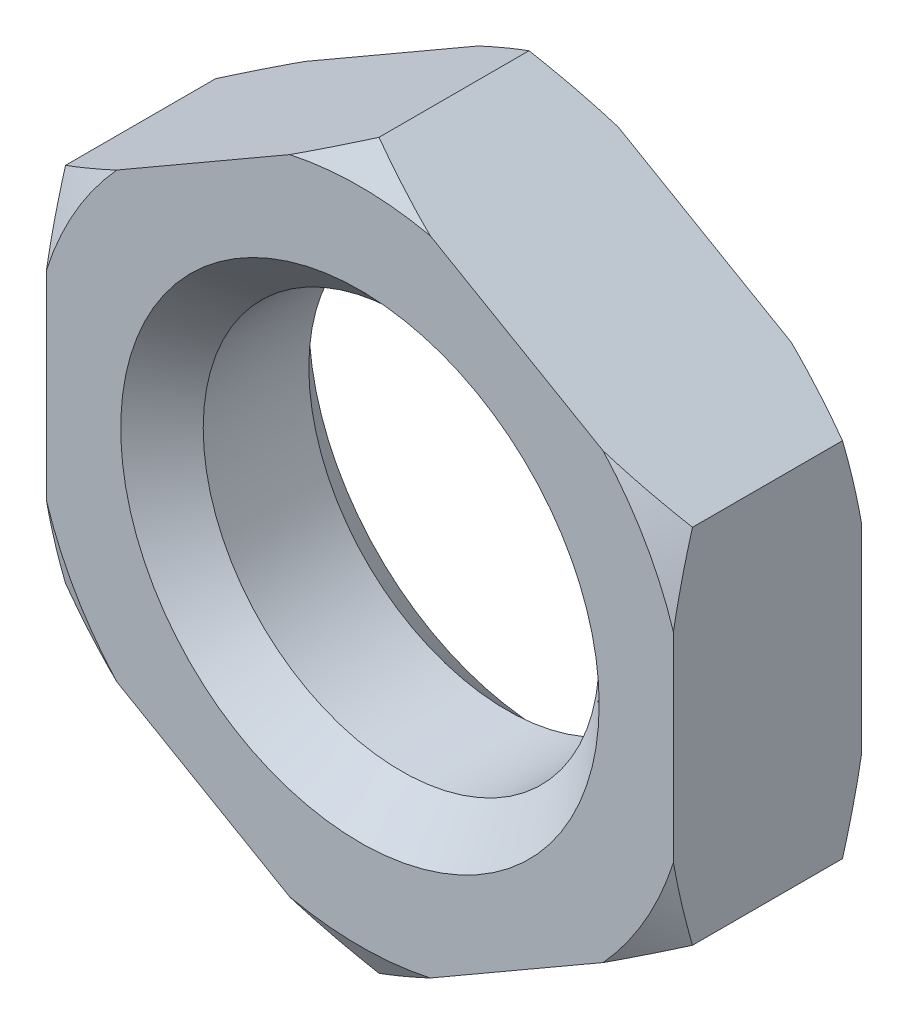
ISO-10303-21;
HEADER;
FILE_DESCRIPTION(('STEP AP214'),'2;1');
FILE_NAME('part.step','',(''),(''),'','','');
FILE_SCHEMA(('AUTOMOTIVE_DESIGN { 1 0 10303 214 1 1 1 1 }'));
ENDSEC;
DATA;
#1=APPLICATION_CONTEXT('core data for automotive mechanical design processes');
#2=APPLICATION_PROTOCOL_DEFINITION('international standard','automotive_design',2000,#1);
#3=PRODUCT_CONTEXT('',#1,'mechanical');
#4=PRODUCT('Part','Part','',(#3));
#5=PRODUCT_RELATED_PRODUCT_CATEGORY('part','',(#4));
#6=PRODUCT_DEFINITION_FORMATION('','',#4);
#7=PRODUCT_DEFINITION_CONTEXT('part definition',#1,'design');
#8=PRODUCT_DEFINITION('design','',#6,#7);
#9=PRODUCT_DEFINITION_SHAPE('','',#8);
#10=(LENGTH_UNIT() NAMED_UNIT(*) SI_UNIT(.MILLI.,.METRE.));
#11=(NAMED_UNIT(*) PLANE_ANGLE_UNIT() SI_UNIT($,.RADIAN.));
#12=(NAMED_UNIT(*) SI_UNIT($,.STERADIAN.) SOLID_ANGLE_UNIT());
#13=UNCERTAINTY_MEASURE_WITH_UNIT(LENGTH_MEASURE(1.E-05),#10,'distance_accuracy_value','');
#14=(GEOMETRIC_REPRESENTATION_CONTEXT(3) GLOBAL_UNCERTAINTY_ASSIGNED_CONTEXT((#13)) GLOBAL_UNIT_ASSIGNED_CONTEXT((#10,
#11,#12)) REPRESENTATION_CONTEXT('',''));
#15=CARTESIAN_POINT('',(0.,0.,0.));
#16=DIRECTION('',(0.,0.,1.));
#17=DIRECTION('',(1.,0.,0.));
#18=AXIS2_PLACEMENT_3D('',#15,#16,#17);
#19=CARTESIAN_POINT('',(0.,0.,-2.85));
#20=DIRECTION('',(0.,0.,1.));
#21=DIRECTION('',(1.,0.,0.));
#22=AXIS2_PLACEMENT_3D('',#19,#20,#21);
#23=PLANE('',#22);
#24=CARTESIAN_POINT('',(0.,0.,-2.85));
#25=DIRECTION('',(0.,0.,1.));
#26=DIRECTION('',(1.,0.,0.));
#27=AXIS2_PLACEMENT_3D('',#24,#25,#26);
#28=CIRCLE('',#27,7.25);
#29=CARTESIAN_POINT('',(-7.25,0.,-2.85));
#30=VERTEX_POINT('',#29);
#31=EDGE_CURVE('E425',#30,#30,#28,.T.);
#32=ORIENTED_EDGE('',*,*,#31,.T.);
#33=EDGE_LOOP('',(#32));
#34=FACE_BOUND('',#33,.T.);
#35=DIRECTION('',(0.,1.,0.));
#36=VECTOR('',#35,1.);
#37=CARTESIAN_POINT('',(9.5,-5.48482755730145,-2.85));
#38=LINE('',#37,#36);
#39=CARTESIAN_POINT('',(9.5,-3.02390858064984,-2.85));
#40=VERTEX_POINT('',#39);
#41=CARTESIAN_POINT('',(9.5,3.02390858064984,-2.85));
#42=VERTEX_POINT('',#41);
#43=EDGE_CURVE('E360',#40,#42,#38,.T.);
#44=ORIENTED_EDGE('',*,*,#43,.F.);
#45=CARTESIAN_POINT('',(0.,0.,-2.85));
#46=DIRECTION('',(0.,0.,-1.));
#47=DIRECTION('',(-1.,0.,0.));
#48=AXIS2_PLACEMENT_3D('',#45,#46,#47);
#49=CIRCLE('',#48,9.96965511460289);
#50=CARTESIAN_POINT('',(7.3687816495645,-6.71528704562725,-2.85));
#51=VERTEX_POINT('',#50);
#52=EDGE_CURVE('E351',#40,#51,#49,.T.);
#53=ORIENTED_EDGE('',*,*,#52,.T.);
#54=DIRECTION('',(0.866025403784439,0.5,0.));
#55=VECTOR('',#54,1.);
#56=CARTESIAN_POINT('',(0.,-10.9696551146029,-2.85));
#57=LINE('',#56,#55);
#58=CARTESIAN_POINT('',(2.1312183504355,-9.73919562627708,-2.85));
#59=VERTEX_POINT('',#58);
#60=EDGE_CURVE('E371',#59,#51,#57,.T.);
#61=ORIENTED_EDGE('',*,*,#60,.F.);
#62=CARTESIAN_POINT('',(-2.13121835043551,-9.73919562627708,-2.85));
#63=VERTEX_POINT('',#62);
#64=EDGE_CURVE('E346',#59,#63,#49,.T.);
#65=ORIENTED_EDGE('',*,*,#64,.T.);
#66=DIRECTION('',(0.866025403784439,-0.5,0.));
#67=VECTOR('',#66,1.);
#68=CARTESIAN_POINT('',(-9.5,-5.48482755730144,-2.85));
#69=LINE('',#68,#67);
#70=CARTESIAN_POINT('',(-7.36878164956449,-6.71528704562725,-2.85));
#71=VERTEX_POINT('',#70);
#72=EDGE_CURVE('E377',#71,#63,#69,.T.);
#73=ORIENTED_EDGE('',*,*,#72,.F.);
#74=CARTESIAN_POINT('',(-9.5,-3.02390858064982,-2.85));
#75=VERTEX_POINT('',#74);
#76=EDGE_CURVE('E339',#71,#75,#49,.T.);
#77=ORIENTED_EDGE('',*,*,#76,.T.);
#78=DIRECTION('',(0.,-1.,0.));
#79=VECTOR('',#78,1.);
#80=CARTESIAN_POINT('',(-9.5,5.48482755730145,-2.85));
#81=LINE('',#80,#79);
#82=CARTESIAN_POINT('',(-9.5,3.02390858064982,-2.85));
#83=VERTEX_POINT('',#82);
#84=EDGE_CURVE('E472',#83,#75,#81,.T.);
#85=ORIENTED_EDGE('',*,*,#84,.F.);
#86=CARTESIAN_POINT('',(-7.36878164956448,6.71528704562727,-2.85));
#87=VERTEX_POINT('',#86);
#88=EDGE_CURVE('E63',#83,#87,#49,.T.);
#89=ORIENTED_EDGE('',*,*,#88,.T.);
#90=DIRECTION('',(-0.866025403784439,-0.5,0.));
#91=VECTOR('',#90,1.);
#92=CARTESIAN_POINT('',(0.,10.9696551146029,-2.85));
#93=LINE('',#92,#91);
#94=CARTESIAN_POINT('',(-2.13121835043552,9.73919562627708,-2.85));
#95=VERTEX_POINT('',#94);
#96=EDGE_CURVE('E181',#95,#87,#93,.T.);
#97=ORIENTED_EDGE('',*,*,#96,.F.);
#98=CARTESIAN_POINT('',(2.13121835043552,9.73919562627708,-2.85));
#99=VERTEX_POINT('',#98);
#100=EDGE_CURVE('E55',#95,#99,#49,.T.);
#101=ORIENTED_EDGE('',*,*,#100,.T.);
#102=DIRECTION('',(-0.866025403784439,0.5,0.));
#103=VECTOR('',#102,1.);
#104=CARTESIAN_POINT('',(9.5,5.48482755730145,-2.85));
#105=LINE('',#104,#103);
#106=CARTESIAN_POINT('',(7.36878164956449,6.71528704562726,-2.85));
#107=VERTEX_POINT('',#106);
#108=EDGE_CURVE('E361',#107,#99,#105,.T.);
#109=ORIENTED_EDGE('',*,*,#108,.F.);
#110=EDGE_CURVE('E343',#107,#42,#49,.T.);
#111=ORIENTED_EDGE('',*,*,#110,.T.);
#112=EDGE_LOOP('',(#44,#53,#61,#65,#73,#77,#85,#89,#97,#101,#109,#111));
#113=FACE_BOUND('',#112,.T.);
#114=ADVANCED_FACE('F39',(#34,#113),#23,.F.);
#115=CARTESIAN_POINT('',(0.,0.,2.85));
#116=DIRECTION('',(0.,0.,1.));
#117=DIRECTION('',(1.,0.,0.));
#118=AXIS2_PLACEMENT_3D('',#115,#116,#117);
#119=PLANE('',#118);
#120=CARTESIAN_POINT('',(0.,0.,2.85));
#121=DIRECTION('',(0.,0.,1.));
#122=DIRECTION('',(1.,0.,0.));
#123=AXIS2_PLACEMENT_3D('',#120,#121,#122);
#124=CIRCLE('',#123,7.25000000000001);
#125=CARTESIAN_POINT('',(7.25000000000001,0.,2.85));
#126=VERTEX_POINT('',#125);
#127=EDGE_CURVE('E11',#126,#126,#124,.F.);
#128=ORIENTED_EDGE('',*,*,#127,.T.);
#129=EDGE_LOOP('',(#128));
#130=FACE_BOUND('',#129,.T.);
#131=CARTESIAN_POINT('',(0.,0.,2.85));
#132=DIRECTION('',(0.,0.,-1.));
#133=DIRECTION('',(-1.,0.,0.));
#134=AXIS2_PLACEMENT_3D('',#131,#132,#133);
#135=CIRCLE('',#134,9.96965511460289);
#136=CARTESIAN_POINT('',(9.5,-3.02390858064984,2.85));
#137=VERTEX_POINT('',#136);
#138=CARTESIAN_POINT('',(7.3687816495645,-6.71528704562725,2.85));
#139=VERTEX_POINT('',#138);
#140=EDGE_CURVE('E316',#137,#139,#135,.T.);
#141=ORIENTED_EDGE('',*,*,#140,.F.);
#142=DIRECTION('',(0.,1.,0.));
#143=VECTOR('',#142,1.);
#144=CARTESIAN_POINT('',(9.5,-5.48482755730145,2.85));
#145=LINE('',#144,#143);
#146=CARTESIAN_POINT('',(9.5,3.02390858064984,2.85));
#147=VERTEX_POINT('',#146);
#148=EDGE_CURVE('E385',#137,#147,#145,.T.);
#149=ORIENTED_EDGE('',*,*,#148,.T.);
#150=CARTESIAN_POINT('',(7.36878164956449,6.71528704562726,2.85));
#151=VERTEX_POINT('',#150);
#152=EDGE_CURVE('E307',#151,#147,#135,.T.);
#153=ORIENTED_EDGE('',*,*,#152,.F.);
#154=DIRECTION('',(-0.866025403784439,0.5,0.));
#155=VECTOR('',#154,1.);
#156=CARTESIAN_POINT('',(9.5,5.48482755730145,2.85));
#157=LINE('',#156,#155);
#158=CARTESIAN_POINT('',(2.13121835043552,9.73919562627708,2.85));
#159=VERTEX_POINT('',#158);
#160=EDGE_CURVE('E370',#151,#159,#157,.T.);
#161=ORIENTED_EDGE('',*,*,#160,.T.);
#162=CARTESIAN_POINT('',(-2.13121835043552,9.73919562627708,2.85));
#163=VERTEX_POINT('',#162);
#164=EDGE_CURVE('E297',#163,#159,#135,.T.);
#165=ORIENTED_EDGE('',*,*,#164,.F.);
#166=DIRECTION('',(-0.866025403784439,-0.5,0.));
#167=VECTOR('',#166,1.);
#168=CARTESIAN_POINT('',(0.,10.9696551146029,2.85));
#169=LINE('',#168,#167);
#170=CARTESIAN_POINT('',(-7.36878164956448,6.71528704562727,2.85));
#171=VERTEX_POINT('',#170);
#172=EDGE_CURVE('E376',#163,#171,#169,.T.);
#173=ORIENTED_EDGE('',*,*,#172,.T.);
#174=CARTESIAN_POINT('',(-9.5,3.02390858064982,2.85));
#175=VERTEX_POINT('',#174);
#176=EDGE_CURVE('E295',#175,#171,#135,.T.);
#177=ORIENTED_EDGE('',*,*,#176,.F.);
#178=DIRECTION('',(0.,-1.,0.));
#179=VECTOR('',#178,1.);
#180=CARTESIAN_POINT('',(-9.5,5.48482755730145,2.85));
#181=LINE('',#180,#179);
#182=CARTESIAN_POINT('',(-9.5,-3.02390858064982,2.85));
#183=VERTEX_POINT('',#182);
#184=EDGE_CURVE('E495',#175,#183,#181,.T.);
#185=ORIENTED_EDGE('',*,*,#184,.T.);
#186=CARTESIAN_POINT('',(-7.36878164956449,-6.71528704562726,2.85));
#187=VERTEX_POINT('',#186);
#188=EDGE_CURVE('E298',#187,#183,#135,.T.);
#189=ORIENTED_EDGE('',*,*,#188,.F.);
#190=DIRECTION('',(0.866025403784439,-0.5,0.));
#191=VECTOR('',#190,1.);
#192=CARTESIAN_POINT('',(-9.5,-5.48482755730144,2.85));
#193=LINE('',#192,#191);
#194=CARTESIAN_POINT('',(-2.13121835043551,-9.73919562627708,2.85));
#195=VERTEX_POINT('',#194);
#196=EDGE_CURVE('E464',#187,#195,#193,.T.);
#197=ORIENTED_EDGE('',*,*,#196,.T.);
#198=CARTESIAN_POINT('',(2.1312183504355,-9.73919562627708,2.85));
#199=VERTEX_POINT('',#198);
#200=EDGE_CURVE('E309',#199,#195,#135,.T.);
#201=ORIENTED_EDGE('',*,*,#200,.F.);
#202=DIRECTION('',(0.866025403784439,0.5,0.));
#203=VECTOR('',#202,1.);
#204=CARTESIAN_POINT('',(0.,-10.9696551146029,2.85));
#205=LINE('',#204,#203);
#206=EDGE_CURVE('E462',#199,#139,#205,.T.);
#207=ORIENTED_EDGE('',*,*,#206,.T.);
#208=EDGE_LOOP('',(#141,#149,#153,#161,#165,#173,#177,#185,#189,#197,#201,#207));
#209=FACE_BOUND('',#208,.T.);
#210=ADVANCED_FACE('F416',(#130,#209),#119,.T.);
#211=CARTESIAN_POINT('',(9.5,5.48482755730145,2.85));
#212=DIRECTION('',(-0.5,-0.866025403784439,0.));
#213=DIRECTION('',(0.866025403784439,-0.5,0.));
#214=AXIS2_PLACEMENT_3D('',#211,#212,#213);
#215=PLANE('',#214);
#216=DIRECTION('',(0.,0.,-1.));
#217=VECTOR('',#216,1.);
#218=CARTESIAN_POINT('',(9.5,5.48482755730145,2.85));
#219=LINE('',#218,#217);
#220=CARTESIAN_POINT('',(9.5,5.48482755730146,2.27264973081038));
#221=VERTEX_POINT('',#220);
#222=CARTESIAN_POINT('',(9.5,5.48482755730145,-2.27264973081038));
#223=VERTEX_POINT('',#222);
#224=EDGE_CURVE('E381',#221,#223,#219,.T.);
#225=ORIENTED_EDGE('',*,*,#224,.T.);
#226=CARTESIAN_POINT('',(16.0911028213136,1.67945256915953,0.734683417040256));
#227=CARTESIAN_POINT('',(15.7926530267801,1.85176263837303,0.573666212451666));
#228=CARTESIAN_POINT('',(15.4934885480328,2.02448533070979,0.414388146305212));
#229=CARTESIAN_POINT('',(14.8934288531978,2.37092995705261,0.100127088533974));
#230=CARTESIAN_POINT('',(14.5925334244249,2.54465201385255,-0.0548553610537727));
#231=CARTESIAN_POINT('',(13.9878148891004,2.8937864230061,-0.360157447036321));
#232=CARTESIAN_POINT('',(13.6839854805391,3.06920241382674,-0.510460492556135));
#233=CARTESIAN_POINT('',(13.0740489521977,3.42134943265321,-0.804758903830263));
#234=CARTESIAN_POINT('',(12.7679419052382,3.59808041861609,-0.94875447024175));
#235=CARTESIAN_POINT('',(12.1452865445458,3.95757065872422,-1.23261207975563));
#236=CARTESIAN_POINT('',(11.8286703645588,4.14036909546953,-1.37227655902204));
#237=CARTESIAN_POINT('',(11.1922429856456,4.50781061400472,-1.64164435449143));
#238=CARTESIAN_POINT('',(10.8724316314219,4.69245378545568,-1.77134718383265));
#239=CARTESIAN_POINT('',(10.2295404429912,5.06362718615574,-2.01831982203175));
#240=CARTESIAN_POINT('',(9.90646410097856,5.25015539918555,-2.13560163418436));
#241=CARTESIAN_POINT('',(9.25651830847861,5.62540177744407,-2.35502233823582));
#242=CARTESIAN_POINT('',(8.92964935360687,5.814119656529,-2.4571631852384));
#243=CARTESIAN_POINT('',(8.14786487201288,6.26548313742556,-2.67807954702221));
#244=CARTESIAN_POINT('',(7.69112739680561,6.52918064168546,-2.78861218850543));
#245=CARTESIAN_POINT('',(7.00135730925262,6.92741958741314,-2.92140056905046));
#246=CARTESIAN_POINT('',(6.77066782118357,7.06060822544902,-2.96016053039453));
#247=CARTESIAN_POINT('',(6.30799755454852,7.3277310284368,-3.0257081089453));
#248=CARTESIAN_POINT('',(6.0760167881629,7.46166518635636,-3.05249583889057));
#249=CARTESIAN_POINT('',(5.61390562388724,7.72846519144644,-3.09308971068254));
#250=CARTESIAN_POINT('',(5.38378495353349,7.86132542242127,-3.10704275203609));
#251=CARTESIAN_POINT('',(4.92322735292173,8.1272284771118,-3.12208284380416));
#252=CARTESIAN_POINT('',(4.69279042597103,8.26027129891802,-3.1231700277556));
#253=CARTESIAN_POINT('',(4.23214422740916,8.52622550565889,-3.11244373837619));
#254=CARTESIAN_POINT('',(4.00193495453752,8.65913689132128,-3.1006303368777));
#255=CARTESIAN_POINT('',(3.54223236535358,8.92454630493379,-3.06446028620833));
#256=CARTESIAN_POINT('',(3.31273916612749,9.05704426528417,-3.04010168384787));
#257=CARTESIAN_POINT('',(2.77042202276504,9.37015121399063,-2.96833387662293));
#258=CARTESIAN_POINT('',(2.45810922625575,9.55046509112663,-2.91573497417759));
#259=CARTESIAN_POINT('',(1.83647686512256,9.90936470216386,-2.79074774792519));
#260=CARTESIAN_POINT('',(1.52715774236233,10.087950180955,-2.71835654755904));
#261=CARTESIAN_POINT('',(0.911549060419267,10.4433720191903,-2.55651778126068));
#262=CARTESIAN_POINT('',(0.60526334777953,10.6202061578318,-2.46705090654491));
#263=CARTESIAN_POINT('',(-0.0038685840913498,10.9718886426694,-2.27387899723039));
#264=CARTESIAN_POINT('',(-0.306715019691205,11.1467371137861,-2.17017486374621));
#265=CARTESIAN_POINT('',(-0.912759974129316,11.496637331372,-1.94968787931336));
#266=CARTESIAN_POINT('',(-1.21591973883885,11.6716667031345,-1.83276398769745));
#267=CARTESIAN_POINT('',(-1.81902771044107,12.0198712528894,-1.58911056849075));
#268=CARTESIAN_POINT('',(-2.11897790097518,12.1930475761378,-1.46238754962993));
#269=CARTESIAN_POINT('',(-2.71614501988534,12.5378221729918,-1.20087494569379));
#270=CARTESIAN_POINT('',(-3.01336251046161,12.7094207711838,-1.06608706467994));
#271=CARTESIAN_POINT('',(-3.60546807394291,13.0512730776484,-0.789856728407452));
#272=CARTESIAN_POINT('',(-3.9003561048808,13.2215267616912,-0.648414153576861));
#273=CARTESIAN_POINT('',(-4.39671248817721,13.5080982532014,-0.40486951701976));
#274=CARTESIAN_POINT('',(-4.59871463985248,13.624724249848,-0.304211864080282));
#275=CARTESIAN_POINT('',(-5.00183994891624,13.8574687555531,-0.100597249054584));
#276=CARTESIAN_POINT('',(-5.20296313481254,13.9735872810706,0.00235963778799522));
#277=CARTESIAN_POINT('',(-5.60231741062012,14.2041545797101,0.209214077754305));
#278=CARTESIAN_POINT('',(-5.80055672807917,14.3186081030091,0.313090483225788));
#279=CARTESIAN_POINT('',(-6.19633679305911,14.5471118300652,0.522613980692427));
#280=CARTESIAN_POINT('',(-6.39387752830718,14.6611620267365,0.628261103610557));
#281=CARTESIAN_POINT('',(-6.59110282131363,14.7750301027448,0.734683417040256));
#282=B_SPLINE_CURVE_WITH_KNOTS('',3,(#226,#227,#228,#229,#230,#231,#232,#233,#234,#235,#236,
#237,#238,#239,#240,#241,#242,#243,#244,#245,#246,#247,#248,#249,#250,#251,#252,#253,#254,#255,
#256,#257,#258,#259,#260,#261,#262,#263,#264,#265,#266,#267,#268,#269,#270,#271,#272,#273,#274,
#275,#276,#277,#278,#279,#280,#281),.UNSPECIFIED.,.F.,.F.,(4,2,2,2,2,2,2,2,2,2,2,2,2,2,2,2,2,2,
2,2,2,2,2,2,2,2,2,4),(0.,1.14115474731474,2.28245284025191,3.42741980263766,4.57235031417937,
5.74632926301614,6.92036555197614,8.0932567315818,9.26599632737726,10.8807998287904,
11.6881240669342,12.4954407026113,13.2933978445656,14.0913467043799,14.8892911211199,
15.6873598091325,16.7800286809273,17.8728564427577,18.9669273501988,20.0609290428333,
21.1679585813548,22.2742590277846,23.380326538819,24.4864139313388,25.2485345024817,
26.010630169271,26.7647435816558,27.5188701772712),.UNSPECIFIED.);
#283=EDGE_CURVE('E320',#223,#107,#282,.T.);
#284=ORIENTED_EDGE('',*,*,#283,.T.);
#285=ORIENTED_EDGE('',*,*,#108,.T.);
#286=CARTESIAN_POINT('',(0.,10.9696551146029,-2.27264973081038));
#287=VERTEX_POINT('',#286);
#288=EDGE_CURVE('E310',#99,#287,#282,.T.);
#289=ORIENTED_EDGE('',*,*,#288,.T.);
#290=DIRECTION('',(0.,0.,-1.));
#291=VECTOR('',#290,1.);
#292=CARTESIAN_POINT('',(0.,10.9696551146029,2.85));
#293=LINE('',#292,#291);
#294=CARTESIAN_POINT('',(0.,10.9696551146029,2.27264973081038));
#295=VERTEX_POINT('',#294);
#296=EDGE_CURVE('E190',#295,#287,#293,.T.);
#297=ORIENTED_EDGE('',*,*,#296,.F.);
#298=CARTESIAN_POINT('',(-6.59110282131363,14.7750301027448,-0.734683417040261));
#299=CARTESIAN_POINT('',(-6.29265302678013,14.6027200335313,-0.573666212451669));
#300=CARTESIAN_POINT('',(-5.99348854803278,14.4299973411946,-0.414388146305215));
#301=CARTESIAN_POINT('',(-5.3934288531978,14.0835527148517,-0.100127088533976));
#302=CARTESIAN_POINT('',(-5.09253342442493,13.9098306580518,0.05485536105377));
#303=CARTESIAN_POINT('',(-4.48781488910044,13.5606962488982,0.360157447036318));
#304=CARTESIAN_POINT('',(-4.18398548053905,13.3852802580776,0.510460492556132));
#305=CARTESIAN_POINT('',(-3.5740489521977,13.0331332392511,0.80475890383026));
#306=CARTESIAN_POINT('',(-3.26794190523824,12.8564022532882,0.948754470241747));
#307=CARTESIAN_POINT('',(-2.64528654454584,12.4969120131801,1.23261207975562));
#308=CARTESIAN_POINT('',(-2.32867036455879,12.3141135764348,1.37227655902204));
#309=CARTESIAN_POINT('',(-1.69224298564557,11.9466720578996,1.64164435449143));
#310=CARTESIAN_POINT('',(-1.37243163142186,11.7620288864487,1.77134718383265));
#311=CARTESIAN_POINT('',(-0.729540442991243,11.3908554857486,2.01831982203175));
#312=CARTESIAN_POINT('',(-0.406464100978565,11.2043272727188,2.13560163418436));
#313=CARTESIAN_POINT('',(0.243481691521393,10.8290808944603,2.35502233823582));
#314=CARTESIAN_POINT('',(0.570350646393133,10.6403630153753,2.4571631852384));
#315=CARTESIAN_POINT('',(1.35213512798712,10.1889995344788,2.67807954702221));
#316=CARTESIAN_POINT('',(1.80887260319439,9.92530203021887,2.78861218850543));
#317=CARTESIAN_POINT('',(2.49864269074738,9.5270630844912,2.92140056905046));
#318=CARTESIAN_POINT('',(2.72933217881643,9.39387444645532,2.96016053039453));
#319=CARTESIAN_POINT('',(3.19200244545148,9.12675164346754,3.0257081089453));
#320=CARTESIAN_POINT('',(3.4239832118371,8.99281748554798,3.05249583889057));
#321=CARTESIAN_POINT('',(3.88609437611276,8.7260174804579,3.09308971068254));
#322=CARTESIAN_POINT('',(4.11621504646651,8.59315724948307,3.10704275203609));
#323=CARTESIAN_POINT('',(4.57677264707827,8.32725419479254,3.12208284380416));
#324=CARTESIAN_POINT('',(4.80720957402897,8.19421137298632,3.1231700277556));
#325=CARTESIAN_POINT('',(5.26785577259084,7.92825716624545,3.11244373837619));
#326=CARTESIAN_POINT('',(5.49806504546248,7.79534578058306,3.1006303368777));
#327=CARTESIAN_POINT('',(5.95776763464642,7.52993636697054,3.06446028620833));
#328=CARTESIAN_POINT('',(6.18726083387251,7.39743840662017,3.04010168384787));
#329=CARTESIAN_POINT('',(6.72957797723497,7.08433145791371,2.96833387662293));
#330=CARTESIAN_POINT('',(7.04189077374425,6.90401758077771,2.91573497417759));
#331=CARTESIAN_POINT('',(7.66352313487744,6.54511796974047,2.79074774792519));
#332=CARTESIAN_POINT('',(7.97284225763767,6.36653249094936,2.71835654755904));
#333=CARTESIAN_POINT('',(8.58845093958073,6.01111065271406,2.55651778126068));
#334=CARTESIAN_POINT('',(8.89473665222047,5.83427651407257,2.46705090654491));
#335=CARTESIAN_POINT('',(9.50386858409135,5.48259402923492,2.27387899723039));
#336=CARTESIAN_POINT('',(9.80671501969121,5.30774555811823,2.17017486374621));
#337=CARTESIAN_POINT('',(10.4127599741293,4.95784534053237,1.94968787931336));
#338=CARTESIAN_POINT('',(10.7159197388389,4.78281596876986,1.83276398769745));
#339=CARTESIAN_POINT('',(11.3190277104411,4.43461141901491,1.58911056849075));
#340=CARTESIAN_POINT('',(11.6189779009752,4.26143509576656,1.46238754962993));
#341=CARTESIAN_POINT('',(12.2161450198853,3.91666049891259,1.2008749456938));
#342=CARTESIAN_POINT('',(12.5133625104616,3.74506190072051,1.06608706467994));
#343=CARTESIAN_POINT('',(13.1054680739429,3.40320959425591,0.789856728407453));
#344=CARTESIAN_POINT('',(13.4003561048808,3.23295591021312,0.648414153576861));
#345=CARTESIAN_POINT('',(13.8967124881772,2.94638441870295,0.404869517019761));
#346=CARTESIAN_POINT('',(14.0987146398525,2.82975842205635,0.304211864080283));
#347=CARTESIAN_POINT('',(14.5018399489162,2.59701391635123,0.100597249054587));
#348=CARTESIAN_POINT('',(14.7029631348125,2.48089539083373,-0.00235963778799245));
#349=CARTESIAN_POINT('',(15.1023174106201,2.2503280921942,-0.209214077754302));
#350=CARTESIAN_POINT('',(15.3005567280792,2.13587456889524,-0.313090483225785));
#351=CARTESIAN_POINT('',(15.6963367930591,1.90737084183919,-0.522613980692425));
#352=CARTESIAN_POINT('',(15.8938775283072,1.7933206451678,-0.628261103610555));
#353=CARTESIAN_POINT('',(16.0911028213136,1.67945256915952,-0.734683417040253));
#354=B_SPLINE_CURVE_WITH_KNOTS('',3,(#298,#299,#300,#301,#302,#303,#304,#305,#306,#307,#308,
#309,#310,#311,#312,#313,#314,#315,#316,#317,#318,#319,#320,#321,#322,#323,#324,#325,#326,#327,
#328,#329,#330,#331,#332,#333,#334,#335,#336,#337,#338,#339,#340,#341,#342,#343,#344,#345,#346,
#347,#348,#349,#350,#351,#352,#353),.UNSPECIFIED.,.F.,.F.,(4,2,2,2,2,2,2,2,2,2,2,2,2,2,2,2,2,2,
2,2,2,2,2,2,2,2,2,4),(0.,1.14115474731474,2.28245284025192,3.42741980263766,4.57235031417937,
5.74632926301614,6.92036555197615,8.09325673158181,9.26599632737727,10.8807998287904,
11.6881240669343,12.4954407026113,13.2933978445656,14.0913467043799,14.8892911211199,
15.6873598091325,16.7800286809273,17.8728564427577,18.9669273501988,20.0609290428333,
21.1679585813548,22.2742590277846,23.380326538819,24.4864139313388,25.2485345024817,
26.010630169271,26.7647435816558,27.5188701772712),.UNSPECIFIED.);
#355=EDGE_CURVE('E469',#295,#159,#354,.T.);
#356=ORIENTED_EDGE('',*,*,#355,.T.);
#357=ORIENTED_EDGE('',*,*,#160,.F.);
#358=EDGE_CURVE('E248',#151,#221,#354,.T.);
#359=ORIENTED_EDGE('',*,*,#358,.T.);
#360=EDGE_LOOP('',(#225,#284,#285,#289,#297,#356,#357,#359));
#361=FACE_BOUND('',#360,.T.);
#362=ADVANCED_FACE('F421',(#361),#215,.F.);
#363=CARTESIAN_POINT('',(0.,10.9696551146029,2.85));
#364=DIRECTION('',(0.5,-0.866025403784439,0.));
#365=DIRECTION('',(0.866025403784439,0.5,0.));
#366=AXIS2_PLACEMENT_3D('',#363,#364,#365);
#367=PLANE('',#366);
#368=ORIENTED_EDGE('',*,*,#296,.T.);
#369=CARTESIAN_POINT('',(6.59110282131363,14.7750301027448,0.734683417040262));
#370=CARTESIAN_POINT('',(6.29265302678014,14.6027200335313,0.573666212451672));
#371=CARTESIAN_POINT('',(5.99348854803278,14.4299973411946,0.414388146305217));
#372=CARTESIAN_POINT('',(5.3934288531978,14.0835527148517,0.100127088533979));
#373=CARTESIAN_POINT('',(5.09253342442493,13.9098306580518,-0.0548553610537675));
#374=CARTESIAN_POINT('',(4.48781488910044,13.5606962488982,-0.360157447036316));
#375=CARTESIAN_POINT('',(4.18398548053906,13.3852802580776,-0.51046049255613));
#376=CARTESIAN_POINT('',(3.57404895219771,13.0331332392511,-0.804758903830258));
#377=CARTESIAN_POINT('',(3.26794190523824,12.8564022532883,-0.948754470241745));
#378=CARTESIAN_POINT('',(2.64528654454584,12.4969120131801,-1.23261207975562));
#379=CARTESIAN_POINT('',(2.32867036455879,12.3141135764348,-1.37227655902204));
#380=CARTESIAN_POINT('',(1.69224298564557,11.9466720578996,-1.64164435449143));
#381=CARTESIAN_POINT('',(1.37243163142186,11.7620288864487,-1.77134718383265));
#382=CARTESIAN_POINT('',(0.729540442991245,11.3908554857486,-2.01831982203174));
#383=CARTESIAN_POINT('',(0.406464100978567,11.2043272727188,-2.13560163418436));
#384=CARTESIAN_POINT('',(-0.243481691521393,10.8290808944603,-2.35502233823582));
#385=CARTESIAN_POINT('',(-0.570350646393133,10.6403630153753,-2.4571631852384));
#386=CARTESIAN_POINT('',(-1.35213512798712,10.1889995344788,-2.67807954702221));
#387=CARTESIAN_POINT('',(-1.80887260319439,9.92530203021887,-2.78861218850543));
#388=CARTESIAN_POINT('',(-2.49864269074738,9.5270630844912,-2.92140056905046));
#389=CARTESIAN_POINT('',(-2.72933217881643,9.39387444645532,-2.96016053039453));
#390=CARTESIAN_POINT('',(-3.19200244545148,9.12675164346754,-3.02570810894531));
#391=CARTESIAN_POINT('',(-3.4239832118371,8.99281748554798,-3.05249583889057));
#392=CARTESIAN_POINT('',(-3.88609437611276,8.7260174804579,-3.09308971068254));
#393=CARTESIAN_POINT('',(-4.11621504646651,8.59315724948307,-3.10704275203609));
#394=CARTESIAN_POINT('',(-4.57677264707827,8.32725419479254,-3.12208284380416));
#395=CARTESIAN_POINT('',(-4.80720957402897,8.19421137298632,-3.1231700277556));
#396=CARTESIAN_POINT('',(-5.26785577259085,7.92825716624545,-3.11244373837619));
#397=CARTESIAN_POINT('',(-5.49806504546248,7.79534578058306,-3.1006303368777));
#398=CARTESIAN_POINT('',(-5.95776763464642,7.52993636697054,-3.06446028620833));
#399=CARTESIAN_POINT('',(-6.18726083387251,7.39743840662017,-3.04010168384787));
#400=CARTESIAN_POINT('',(-6.72957797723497,7.08433145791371,-2.96833387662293));
#401=CARTESIAN_POINT('',(-7.04189077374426,6.90401758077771,-2.91573497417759));
#402=CARTESIAN_POINT('',(-7.66352313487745,6.54511796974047,-2.79074774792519));
#403=CARTESIAN_POINT('',(-7.97284225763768,6.36653249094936,-2.71835654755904));
#404=CARTESIAN_POINT('',(-8.58845093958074,6.01111065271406,-2.55651778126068));
#405=CARTESIAN_POINT('',(-8.89473665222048,5.83427651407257,-2.4670509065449));
#406=CARTESIAN_POINT('',(-9.50386858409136,5.48259402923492,-2.27387899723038));
#407=CARTESIAN_POINT('',(-9.80671501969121,5.30774555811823,-2.17017486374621));
#408=CARTESIAN_POINT('',(-10.4127599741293,4.95784534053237,-1.94968787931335));
#409=CARTESIAN_POINT('',(-10.7159197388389,4.78281596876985,-1.83276398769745));
#410=CARTESIAN_POINT('',(-11.3190277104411,4.4346114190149,-1.58911056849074));
#411=CARTESIAN_POINT('',(-11.6189779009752,4.26143509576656,-1.46238754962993));
#412=CARTESIAN_POINT('',(-12.2161450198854,3.91666049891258,-1.20087494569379));
#413=CARTESIAN_POINT('',(-12.5133625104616,3.7450619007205,-1.06608706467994));
#414=CARTESIAN_POINT('',(-13.1054680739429,3.4032095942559,-0.789856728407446));
#415=CARTESIAN_POINT('',(-13.4003561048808,3.23295591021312,-0.648414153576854));
#416=CARTESIAN_POINT('',(-13.8967124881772,2.94638441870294,-0.404869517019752));
#417=CARTESIAN_POINT('',(-14.0987146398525,2.82975842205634,-0.304211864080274));
#418=CARTESIAN_POINT('',(-14.5018399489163,2.59701391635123,-0.100597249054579));
#419=CARTESIAN_POINT('',(-14.7029631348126,2.48089539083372,0.00235963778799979));
#420=CARTESIAN_POINT('',(-15.1023174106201,2.25032809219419,0.209214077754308));
#421=CARTESIAN_POINT('',(-15.3005567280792,2.13587456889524,0.313090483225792));
#422=CARTESIAN_POINT('',(-15.6963367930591,1.90737084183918,0.522613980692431));
#423=CARTESIAN_POINT('',(-15.8938775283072,1.7933206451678,0.62826110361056));
#424=CARTESIAN_POINT('',(-16.0911028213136,1.67945256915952,0.734683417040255));
#425=B_SPLINE_CURVE_WITH_KNOTS('',3,(#369,#370,#371,#372,#373,#374,#375,#376,#377,#378,#379,
#380,#381,#382,#383,#384,#385,#386,#387,#388,#389,#390,#391,#392,#393,#394,#395,#396,#397,#398,
#399,#400,#401,#402,#403,#404,#405,#406,#407,#408,#409,#410,#411,#412,#413,#414,#415,#416,#417,
#418,#419,#420,#421,#422,#423,#424),.UNSPECIFIED.,.F.,.F.,(4,2,2,2,2,2,2,2,2,2,2,2,2,2,2,2,2,2,
2,2,2,2,2,2,2,2,2,4),(0.,1.14115474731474,2.28245284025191,3.42741980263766,4.57235031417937,
5.74632926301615,6.92036555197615,8.09325673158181,9.26599632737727,10.8807998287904,
11.6881240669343,12.4954407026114,13.2933978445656,14.0913467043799,14.8892911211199,
15.6873598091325,16.7800286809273,17.8728564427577,18.9669273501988,20.0609290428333,
21.1679585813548,22.2742590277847,23.380326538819,24.4864139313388,25.2485345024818,
26.010630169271,26.7647435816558,27.5188701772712),.UNSPECIFIED.);
#426=EDGE_CURVE('E183',#287,#95,#425,.T.);
#427=ORIENTED_EDGE('',*,*,#426,.T.);
#428=ORIENTED_EDGE('',*,*,#96,.T.);
#429=CARTESIAN_POINT('',(-9.5,5.48482755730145,-2.27264973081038));
#430=VERTEX_POINT('',#429);
#431=EDGE_CURVE('E165',#87,#430,#425,.T.);
#432=ORIENTED_EDGE('',*,*,#431,.T.);
#433=DIRECTION('',(0.,0.,-1.));
#434=VECTOR('',#433,1.);
#435=CARTESIAN_POINT('',(-9.5,5.48482755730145,2.85));
#436=LINE('',#435,#434);
#437=CARTESIAN_POINT('',(-9.5,5.48482755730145,2.27264973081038));
#438=VERTEX_POINT('',#437);
#439=EDGE_CURVE('E179',#438,#430,#436,.T.);
#440=ORIENTED_EDGE('',*,*,#439,.F.);
#441=CARTESIAN_POINT('',(-16.0911028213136,1.67945256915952,-0.73468341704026));
#442=CARTESIAN_POINT('',(-15.7926530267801,1.85176263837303,-0.573666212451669));
#443=CARTESIAN_POINT('',(-15.4934885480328,2.02448533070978,-0.414388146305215));
#444=CARTESIAN_POINT('',(-14.8934288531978,2.3709299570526,-0.100127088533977));
#445=CARTESIAN_POINT('',(-14.5925334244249,2.54465201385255,0.0548553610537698));
#446=CARTESIAN_POINT('',(-13.9878148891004,2.8937864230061,0.360157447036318));
#447=CARTESIAN_POINT('',(-13.6839854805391,3.06920241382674,0.510460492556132));
#448=CARTESIAN_POINT('',(-13.0740489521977,3.42134943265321,0.80475890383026));
#449=CARTESIAN_POINT('',(-12.7679419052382,3.59808041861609,0.948754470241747));
#450=CARTESIAN_POINT('',(-12.1452865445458,3.95757065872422,1.23261207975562));
#451=CARTESIAN_POINT('',(-11.8286703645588,4.14036909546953,1.37227655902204));
#452=CARTESIAN_POINT('',(-11.1922429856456,4.50781061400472,1.64164435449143));
#453=CARTESIAN_POINT('',(-10.8724316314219,4.69245378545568,1.77134718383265));
#454=CARTESIAN_POINT('',(-10.2295404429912,5.06362718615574,2.01831982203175));
#455=CARTESIAN_POINT('',(-9.90646410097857,5.25015539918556,2.13560163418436));
#456=CARTESIAN_POINT('',(-9.25651830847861,5.62540177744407,2.35502233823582));
#457=CARTESIAN_POINT('',(-8.92964935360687,5.814119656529,2.4571631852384));
#458=CARTESIAN_POINT('',(-8.14786487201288,6.26548313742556,2.67807954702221));
#459=CARTESIAN_POINT('',(-7.69112739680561,6.52918064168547,2.78861218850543));
#460=CARTESIAN_POINT('',(-7.00135730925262,6.92741958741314,2.92140056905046));
#461=CARTESIAN_POINT('',(-6.77066782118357,7.06060822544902,2.96016053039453));
#462=CARTESIAN_POINT('',(-6.30799755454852,7.3277310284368,3.02570810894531));
#463=CARTESIAN_POINT('',(-6.0760167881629,7.46166518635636,3.05249583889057));
#464=CARTESIAN_POINT('',(-5.61390562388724,7.72846519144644,3.09308971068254));
#465=CARTESIAN_POINT('',(-5.38378495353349,7.86132542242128,3.10704275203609));
#466=CARTESIAN_POINT('',(-4.92322735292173,8.12722847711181,3.12208284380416));
#467=CARTESIAN_POINT('',(-4.69279042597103,8.26027129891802,3.1231700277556));
#468=CARTESIAN_POINT('',(-4.23214422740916,8.5262255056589,3.11244373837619));
#469=CARTESIAN_POINT('',(-4.00193495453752,8.65913689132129,3.1006303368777));
#470=CARTESIAN_POINT('',(-3.54223236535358,8.9245463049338,3.06446028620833));
#471=CARTESIAN_POINT('',(-3.31273916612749,9.05704426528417,3.04010168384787));
#472=CARTESIAN_POINT('',(-2.77042202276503,9.37015121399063,2.96833387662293));
#473=CARTESIAN_POINT('',(-2.45810922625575,9.55046509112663,2.91573497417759));
#474=CARTESIAN_POINT('',(-1.83647686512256,9.90936470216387,2.79074774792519));
#475=CARTESIAN_POINT('',(-1.52715774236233,10.087950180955,2.71835654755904));
#476=CARTESIAN_POINT('',(-0.911549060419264,10.4433720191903,2.55651778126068));
#477=CARTESIAN_POINT('',(-0.605263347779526,10.6202061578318,2.4670509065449));
#478=CARTESIAN_POINT('',(0.00386858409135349,10.9718886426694,2.27387899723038));
#479=CARTESIAN_POINT('',(0.306715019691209,11.1467371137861,2.17017486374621));
#480=CARTESIAN_POINT('',(0.912759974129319,11.496637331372,1.94968787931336));
#481=CARTESIAN_POINT('',(1.21591973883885,11.6716667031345,1.83276398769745));
#482=CARTESIAN_POINT('',(1.81902771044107,12.0198712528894,1.58911056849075));
#483=CARTESIAN_POINT('',(2.11897790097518,12.1930475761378,1.46238754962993));
#484=CARTESIAN_POINT('',(2.71614501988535,12.5378221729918,1.20087494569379));
#485=CARTESIAN_POINT('',(3.01336251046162,12.7094207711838,1.06608706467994));
#486=CARTESIAN_POINT('',(3.60546807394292,13.0512730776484,0.789856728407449));
#487=CARTESIAN_POINT('',(3.9003561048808,13.2215267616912,0.648414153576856));
#488=CARTESIAN_POINT('',(4.39671248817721,13.5080982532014,0.404869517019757));
#489=CARTESIAN_POINT('',(4.59871463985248,13.624724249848,0.30421186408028));
#490=CARTESIAN_POINT('',(5.00183994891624,13.8574687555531,0.100597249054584));
#491=CARTESIAN_POINT('',(5.20296313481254,13.9735872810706,-0.00235963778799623));
#492=CARTESIAN_POINT('',(5.60231741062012,14.2041545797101,-0.209214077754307));
#493=CARTESIAN_POINT('',(5.80055672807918,14.3186081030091,-0.313090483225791));
#494=CARTESIAN_POINT('',(6.19633679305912,14.5471118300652,-0.522613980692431));
#495=CARTESIAN_POINT('',(6.39387752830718,14.6611620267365,-0.628261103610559));
#496=CARTESIAN_POINT('',(6.59110282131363,14.7750301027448,-0.734683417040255));
#497=B_SPLINE_CURVE_WITH_KNOTS('',3,(#441,#442,#443,#444,#445,#446,#447,#448,#449,#450,#451,
#452,#453,#454,#455,#456,#457,#458,#459,#460,#461,#462,#463,#464,#465,#466,#467,#468,#469,#470,
#471,#472,#473,#474,#475,#476,#477,#478,#479,#480,#481,#482,#483,#484,#485,#486,#487,#488,#489,
#490,#491,#492,#493,#494,#495,#496),.UNSPECIFIED.,.F.,.F.,(4,2,2,2,2,2,2,2,2,2,2,2,2,2,2,2,2,2,
2,2,2,2,2,2,2,2,2,4),(0.,1.14115474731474,2.28245284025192,3.42741980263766,4.57235031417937,
5.74632926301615,6.92036555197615,8.0932567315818,9.26599632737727,10.8807998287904,
11.6881240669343,12.4954407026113,13.2933978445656,14.0913467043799,14.8892911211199,
15.6873598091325,16.7800286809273,17.8728564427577,18.9669273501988,20.0609290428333,
21.1679585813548,22.2742590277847,23.380326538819,24.4864139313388,25.2485345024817,
26.010630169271,26.7647435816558,27.5188701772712),.UNSPECIFIED.);
#498=EDGE_CURVE('E268',#438,#171,#497,.T.);
#499=ORIENTED_EDGE('',*,*,#498,.T.);
#500=ORIENTED_EDGE('',*,*,#172,.F.);
#501=EDGE_CURVE('E487',#163,#295,#497,.T.);
#502=ORIENTED_EDGE('',*,*,#501,.T.);
#503=EDGE_LOOP('',(#368,#427,#428,#432,#440,#499,#500,#502));
#504=FACE_BOUND('',#503,.T.);
#505=ADVANCED_FACE('F177',(#504),#367,.F.);
#506=CARTESIAN_POINT('',(-9.5,5.48482755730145,2.85));
#507=DIRECTION('',(1.,0.,0.));
#508=DIRECTION('',(0.,0.,-1.));
#509=AXIS2_PLACEMENT_3D('',#506,#507,#508);
#510=PLANE('',#509);
#511=ORIENTED_EDGE('',*,*,#439,.T.);
#512=CARTESIAN_POINT('',(-9.5,12.0759303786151,0.264907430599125));
#513=CARTESIAN_POINT('',(-9.5,11.7327439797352,0.109222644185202));
#514=CARTESIAN_POINT('',(-9.5,11.388618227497,-0.0444309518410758));
#515=CARTESIAN_POINT('',(-9.5,10.698085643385,-0.346690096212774));
#516=CARTESIAN_POINT('',(-9.5,10.3516784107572,-0.495294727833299));
#517=CARTESIAN_POINT('',(-9.5,9.65484997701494,-0.787022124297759));
#518=CARTESIAN_POINT('',(-9.5,9.30441804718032,-0.930119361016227));
#519=CARTESIAN_POINT('',(-9.5,8.6005902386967,-1.2088098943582));
#520=CARTESIAN_POINT('',(-9.5,8.2471944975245,-1.34440353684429));
#521=CARTESIAN_POINT('',(-9.5,7.53860340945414,-1.60582574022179));
#522=CARTESIAN_POINT('',(-9.5,7.18342337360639,-1.7316955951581));
#523=CARTESIAN_POINT('',(-9.5,6.46926569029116,-1.97229858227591));
#524=CARTESIAN_POINT('',(-9.5,6.11028785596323,-2.08703116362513));
#525=CARTESIAN_POINT('',(-9.5,5.38872372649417,-2.30272419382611));
#526=CARTESIAN_POINT('',(-9.5,5.02614305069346,-2.40370330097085));
#527=CARTESIAN_POINT('',(-9.5,4.29675196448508,-2.58920160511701));
#528=CARTESIAN_POINT('',(-9.5,3.92994173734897,-2.67372151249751));
#529=CARTESIAN_POINT('',(-9.5,3.29665308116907,-2.80205940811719));
#530=CARTESIAN_POINT('',(-9.5,3.03113701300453,-2.85062833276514));
#531=CARTESIAN_POINT('',(-9.5,2.49832809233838,-2.9365841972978));
#532=CARTESIAN_POINT('',(-9.5,2.23103554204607,-2.97397299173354));
#533=CARTESIAN_POINT('',(-9.5,1.69506861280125,-3.03659004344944));
#534=CARTESIAN_POINT('',(-9.5,1.4263944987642,-3.06182055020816));
#535=CARTESIAN_POINT('',(-9.5,0.88813869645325,-3.09939803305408));
#536=CARTESIAN_POINT('',(-9.5,0.618557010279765,-3.11174503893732));
#537=CARTESIAN_POINT('',(-9.5,0.079245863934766,-3.12317034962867));
#538=CARTESIAN_POINT('',(-9.5,-0.190483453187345,-3.12225534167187));
#539=CARTESIAN_POINT('',(-9.5,-0.729567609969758,-3.10720205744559));
#540=CARTESIAN_POINT('',(-9.5,-0.998922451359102,-3.09306384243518));
#541=CARTESIAN_POINT('',(-9.5,-1.53667618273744,-3.05199575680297));
#542=CARTESIAN_POINT('',(-9.5,-1.80507496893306,-3.02506453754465));
#543=CARTESIAN_POINT('',(-9.5,-2.34038611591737,-2.95918517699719));
#544=CARTESIAN_POINT('',(-9.5,-2.60729841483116,-2.92023653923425));
#545=CARTESIAN_POINT('',(-9.5,-3.2716640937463,-2.80918941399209));
#546=CARTESIAN_POINT('',(-9.5,-3.66797754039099,-2.73023980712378));
#547=CARTESIAN_POINT('',(-9.5,-4.45585575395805,-2.55141943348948));
#548=CARTESIAN_POINT('',(-9.5,-4.84741945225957,-2.45154404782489));
#549=CARTESIAN_POINT('',(-9.5,-5.62657130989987,-2.2343894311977));
#550=CARTESIAN_POINT('',(-9.5,-6.01414884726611,-2.11707245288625));
#551=CARTESIAN_POINT('',(-9.5,-6.78474185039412,-1.86851091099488));
#552=CARTESIAN_POINT('',(-9.5,-7.16775763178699,-1.73726731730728));
#553=CARTESIAN_POINT('',(-9.5,-7.93407213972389,-1.46202298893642));
#554=CARTESIAN_POINT('',(-9.5,-8.31732458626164,-1.31789419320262));
#555=CARTESIAN_POINT('',(-9.5,-9.08024927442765,-1.02043108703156));
#556=CARTESIAN_POINT('',(-9.5,-9.45992128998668,-0.867096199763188));
#557=CARTESIAN_POINT('',(-9.5,-10.2138362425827,-0.553978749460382));
#558=CARTESIAN_POINT('',(-9.5,-10.5880982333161,-0.394241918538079));
#559=CARTESIAN_POINT('',(-9.5,-11.1474871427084,-0.150184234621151));
#560=CARTESIAN_POINT('',(-9.5,-11.3335947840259,-0.0680993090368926));
#561=CARTESIAN_POINT('',(-9.5,-11.7052038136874,0.0974231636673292));
#562=CARTESIAN_POINT('',(-9.5,-11.8907052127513,0.180860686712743));
#563=CARTESIAN_POINT('',(-9.5,-12.0759303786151,0.264907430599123));
#564=B_SPLINE_CURVE_WITH_KNOTS('',3,(#512,#513,#514,#515,#516,#517,#518,#519,#520,#521,#522,
#523,#524,#525,#526,#527,#528,#529,#530,#531,#532,#533,#534,#535,#536,#537,#538,#539,#540,#541,
#542,#543,#544,#545,#546,#547,#548,#549,#550,#551,#552,#553,#554,#555,#556,#557,#558,#559,#560,
#561,#562,#563),.UNSPECIFIED.,.F.,.F.,(4,2,2,2,2,2,2,2,2,2,2,2,2,2,2,2,2,2,2,2,2,2,2,2,2,4),(0.,
1.13056270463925,2.26132959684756,3.39682602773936,4.53227007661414,5.66259174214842,
6.79296928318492,7.92179771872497,9.0505774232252,9.86013572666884,10.6695596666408,
11.4788337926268,12.288106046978,13.0969702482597,13.9058307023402,14.7147764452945,
15.5237556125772,16.7353316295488,17.9471753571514,19.1616810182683,20.3761021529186,
21.6043286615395,22.8326322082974,24.0533405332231,24.6635541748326,25.273756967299),.UNSPECIFIED.);
#565=EDGE_CURVE('E162',#430,#83,#564,.T.);
#566=ORIENTED_EDGE('',*,*,#565,.T.);
#567=ORIENTED_EDGE('',*,*,#84,.T.);
#568=CARTESIAN_POINT('',(-9.50000000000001,-5.48482755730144,-2.27264973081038));
#569=VERTEX_POINT('',#568);
#570=EDGE_CURVE('E171',#75,#569,#564,.T.);
#571=ORIENTED_EDGE('',*,*,#570,.T.);
#572=DIRECTION('',(0.,0.,-1.));
#573=VECTOR('',#572,1.);
#574=CARTESIAN_POINT('',(-9.5,-5.48482755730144,2.85));
#575=LINE('',#574,#573);
#576=CARTESIAN_POINT('',(-9.5,-5.48482755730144,2.27264973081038));
#577=VERTEX_POINT('',#576);
#578=EDGE_CURVE('E191',#577,#569,#575,.T.);
#579=ORIENTED_EDGE('',*,*,#578,.F.);
#580=CARTESIAN_POINT('',(-9.5,-12.0759303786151,-0.264907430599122));
#581=CARTESIAN_POINT('',(-9.5,-11.7327439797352,-0.109222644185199));
#582=CARTESIAN_POINT('',(-9.5,-11.388618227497,0.044430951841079));
#583=CARTESIAN_POINT('',(-9.5,-10.698085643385,0.346690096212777));
#584=CARTESIAN_POINT('',(-9.5,-10.3516784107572,0.495294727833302));
#585=CARTESIAN_POINT('',(-9.5,-9.65484997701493,0.787022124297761));
#586=CARTESIAN_POINT('',(-9.5,-9.30441804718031,0.93011936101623));
#587=CARTESIAN_POINT('',(-9.5,-8.60059023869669,1.20880989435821));
#588=CARTESIAN_POINT('',(-9.5,-8.24719449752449,1.3444035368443));
#589=CARTESIAN_POINT('',(-9.5,-7.53860340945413,1.60582574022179));
#590=CARTESIAN_POINT('',(-9.5,-7.18342337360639,1.7316955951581));
#591=CARTESIAN_POINT('',(-9.5,-6.46926569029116,1.97229858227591));
#592=CARTESIAN_POINT('',(-9.5,-6.11028785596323,2.08703116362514));
#593=CARTESIAN_POINT('',(-9.5,-5.38872372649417,2.30272419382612));
#594=CARTESIAN_POINT('',(-9.5,-5.02614305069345,2.40370330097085));
#595=CARTESIAN_POINT('',(-9.5,-4.29675196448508,2.58920160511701));
#596=CARTESIAN_POINT('',(-9.5,-3.92994173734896,2.67372151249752));
#597=CARTESIAN_POINT('',(-9.5,-3.29665308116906,2.80205940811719));
#598=CARTESIAN_POINT('',(-9.5,-3.03113701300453,2.85062833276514));
#599=CARTESIAN_POINT('',(-9.5,-2.49832809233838,2.9365841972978));
#600=CARTESIAN_POINT('',(-9.5,-2.23103554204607,2.97397299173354));
#601=CARTESIAN_POINT('',(-9.5,-1.69506861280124,3.03659004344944));
#602=CARTESIAN_POINT('',(-9.5,-1.42639449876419,3.06182055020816));
#603=CARTESIAN_POINT('',(-9.5,-0.888138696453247,3.09939803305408));
#604=CARTESIAN_POINT('',(-9.5,-0.618557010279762,3.11174503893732));
#605=CARTESIAN_POINT('',(-9.5,-0.0792458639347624,3.12317034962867));
#606=CARTESIAN_POINT('',(-9.5,0.190483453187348,3.12225534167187));
#607=CARTESIAN_POINT('',(-9.5,0.729567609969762,3.10720205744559));
#608=CARTESIAN_POINT('',(-9.5,0.998922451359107,3.09306384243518));
#609=CARTESIAN_POINT('',(-9.5,1.53667618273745,3.05199575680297));
#610=CARTESIAN_POINT('',(-9.5,1.80507496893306,3.02506453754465));
#611=CARTESIAN_POINT('',(-9.5,2.34038611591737,2.95918517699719));
#612=CARTESIAN_POINT('',(-9.5,2.60729841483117,2.92023653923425));
#613=CARTESIAN_POINT('',(-9.5,3.2716640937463,2.80918941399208));
#614=CARTESIAN_POINT('',(-9.5,3.667977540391,2.73023980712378));
#615=CARTESIAN_POINT('',(-9.5,4.45585575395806,2.55141943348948));
#616=CARTESIAN_POINT('',(-9.5,4.84741945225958,2.45154404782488));
#617=CARTESIAN_POINT('',(-9.5,5.62657130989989,2.23438943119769));
#618=CARTESIAN_POINT('',(-9.5,6.01414884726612,2.11707245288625));
#619=CARTESIAN_POINT('',(-9.5,6.78474185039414,1.86851091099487));
#620=CARTESIAN_POINT('',(-9.5,7.16775763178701,1.73726731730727));
#621=CARTESIAN_POINT('',(-9.5,7.9340721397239,1.46202298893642));
#622=CARTESIAN_POINT('',(-9.5,8.31732458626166,1.31789419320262));
#623=CARTESIAN_POINT('',(-9.5,9.08024927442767,1.02043108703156));
#624=CARTESIAN_POINT('',(-9.5,9.4599212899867,0.867096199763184));
#625=CARTESIAN_POINT('',(-9.5,10.2138362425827,0.553978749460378));
#626=CARTESIAN_POINT('',(-9.5,10.5880982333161,0.394241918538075));
#627=CARTESIAN_POINT('',(-9.5,11.1474871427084,0.150184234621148));
#628=CARTESIAN_POINT('',(-9.5,11.3335947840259,0.06809930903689));
#629=CARTESIAN_POINT('',(-9.5,11.7052038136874,-0.0974231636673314));
#630=CARTESIAN_POINT('',(-9.5,11.8907052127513,-0.180860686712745));
#631=CARTESIAN_POINT('',(-9.5,12.0759303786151,-0.264907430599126));
#632=B_SPLINE_CURVE_WITH_KNOTS('',3,(#580,#581,#582,#583,#584,#585,#586,#587,#588,#589,#590,
#591,#592,#593,#594,#595,#596,#597,#598,#599,#600,#601,#602,#603,#604,#605,#606,#607,#608,#609,
#610,#611,#612,#613,#614,#615,#616,#617,#618,#619,#620,#621,#622,#623,#624,#625,#626,#627,#628,
#629,#630,#631),.UNSPECIFIED.,.F.,.F.,(4,2,2,2,2,2,2,2,2,2,2,2,2,2,2,2,2,2,2,2,2,2,2,2,2,4),(0.,
1.13056270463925,2.26132959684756,3.39682602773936,4.53227007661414,5.66259174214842,
6.79296928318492,7.92179771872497,9.0505774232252,9.86013572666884,10.6695596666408,
11.4788337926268,12.288106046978,13.0969702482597,13.9058307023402,14.7147764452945,
15.5237556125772,16.7353316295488,17.9471753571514,19.1616810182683,20.3761021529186,
21.6043286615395,22.8326322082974,24.0533405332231,24.6635541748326,25.273756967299),.UNSPECIFIED.);
#633=EDGE_CURVE('E260',#577,#183,#632,.T.);
#634=ORIENTED_EDGE('',*,*,#633,.T.);
#635=ORIENTED_EDGE('',*,*,#184,.F.);
#636=EDGE_CURVE('E188',#175,#438,#632,.T.);
#637=ORIENTED_EDGE('',*,*,#636,.T.);
#638=EDGE_LOOP('',(#511,#566,#567,#571,#579,#634,#635,#637));
#639=FACE_BOUND('',#638,.T.);
#640=ADVANCED_FACE('F186',(#639),#510,.F.);
#641=CARTESIAN_POINT('',(-9.5,-5.48482755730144,2.85));
#642=DIRECTION('',(0.5,0.866025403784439,0.));
#643=DIRECTION('',(-0.866025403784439,0.5,0.));
#644=AXIS2_PLACEMENT_3D('',#641,#642,#643);
#645=PLANE('',#644);
#646=ORIENTED_EDGE('',*,*,#578,.T.);
#647=CARTESIAN_POINT('',(-16.0911028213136,-1.67945256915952,0.73468341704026));
#648=CARTESIAN_POINT('',(-15.7926530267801,-1.85176263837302,0.57366621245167));
#649=CARTESIAN_POINT('',(-15.4934885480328,-2.02448533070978,0.414388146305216));
#650=CARTESIAN_POINT('',(-14.8934288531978,-2.3709299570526,0.100127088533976));
#651=CARTESIAN_POINT('',(-14.5925334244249,-2.54465201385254,-0.054855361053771));
#652=CARTESIAN_POINT('',(-13.9878148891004,-2.89378642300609,-0.36015744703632));
#653=CARTESIAN_POINT('',(-13.6839854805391,-3.06920241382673,-0.510460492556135));
#654=CARTESIAN_POINT('',(-13.0740489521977,-3.4213494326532,-0.804758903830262));
#655=CARTESIAN_POINT('',(-12.7679419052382,-3.59808041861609,-0.948754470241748));
#656=CARTESIAN_POINT('',(-12.1452865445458,-3.95757065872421,-1.23261207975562));
#657=CARTESIAN_POINT('',(-11.8286703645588,-4.14036909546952,-1.37227655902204));
#658=CARTESIAN_POINT('',(-11.1922429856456,-4.50781061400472,-1.64164435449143));
#659=CARTESIAN_POINT('',(-10.8724316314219,-4.69245378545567,-1.77134718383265));
#660=CARTESIAN_POINT('',(-10.2295404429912,-5.06362718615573,-2.01831982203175));
#661=CARTESIAN_POINT('',(-9.90646410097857,-5.25015539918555,-2.13560163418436));
#662=CARTESIAN_POINT('',(-9.25651830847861,-5.62540177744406,-2.35502233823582));
#663=CARTESIAN_POINT('',(-8.92964935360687,-5.81411965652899,-2.4571631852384));
#664=CARTESIAN_POINT('',(-8.14786487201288,-6.26548313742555,-2.67807954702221));
#665=CARTESIAN_POINT('',(-7.69112739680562,-6.52918064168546,-2.78861218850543));
#666=CARTESIAN_POINT('',(-7.00135730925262,-6.92741958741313,-2.92140056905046));
#667=CARTESIAN_POINT('',(-6.77066782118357,-7.06060822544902,-2.96016053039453));
#668=CARTESIAN_POINT('',(-6.30799755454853,-7.3277310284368,-3.02570810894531));
#669=CARTESIAN_POINT('',(-6.0760167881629,-7.46166518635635,-3.05249583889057));
#670=CARTESIAN_POINT('',(-5.61390562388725,-7.72846519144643,-3.09308971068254));
#671=CARTESIAN_POINT('',(-5.38378495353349,-7.86132542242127,-3.1070427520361));
#672=CARTESIAN_POINT('',(-4.92322735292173,-8.1272284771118,-3.12208284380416));
#673=CARTESIAN_POINT('',(-4.69279042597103,-8.26027129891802,-3.1231700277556));
#674=CARTESIAN_POINT('',(-4.23214422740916,-8.52622550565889,-3.11244373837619));
#675=CARTESIAN_POINT('',(-4.00193495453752,-8.65913689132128,-3.1006303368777));
#676=CARTESIAN_POINT('',(-3.54223236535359,-8.92454630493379,-3.06446028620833));
#677=CARTESIAN_POINT('',(-3.3127391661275,-9.05704426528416,-3.04010168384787));
#678=CARTESIAN_POINT('',(-2.77042202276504,-9.37015121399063,-2.96833387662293));
#679=CARTESIAN_POINT('',(-2.45810922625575,-9.55046509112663,-2.91573497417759));
#680=CARTESIAN_POINT('',(-1.83647686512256,-9.90936470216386,-2.79074774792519));
#681=CARTESIAN_POINT('',(-1.52715774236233,-10.087950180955,-2.71835654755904));
#682=CARTESIAN_POINT('',(-0.911549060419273,-10.4433720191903,-2.55651778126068));
#683=CARTESIAN_POINT('',(-0.605263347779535,-10.6202061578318,-2.46705090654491));
#684=CARTESIAN_POINT('',(0.00386858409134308,-10.9718886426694,-2.27387899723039));
#685=CARTESIAN_POINT('',(0.306715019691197,-11.1467371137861,-2.17017486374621));
#686=CARTESIAN_POINT('',(0.912759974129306,-11.496637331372,-1.94968787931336));
#687=CARTESIAN_POINT('',(1.21591973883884,-11.6716667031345,-1.83276398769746));
#688=CARTESIAN_POINT('',(1.81902771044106,-12.0198712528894,-1.58911056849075));
#689=CARTESIAN_POINT('',(2.11897790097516,-12.1930475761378,-1.46238754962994));
#690=CARTESIAN_POINT('',(2.71614501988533,-12.5378221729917,-1.2008749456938));
#691=CARTESIAN_POINT('',(3.0133625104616,-12.7094207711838,-1.06608706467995));
#692=CARTESIAN_POINT('',(3.6054680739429,-13.0512730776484,-0.789856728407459));
#693=CARTESIAN_POINT('',(3.90035610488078,-13.2215267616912,-0.648414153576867));
#694=CARTESIAN_POINT('',(4.3967124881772,-13.5080982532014,-0.404869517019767));
#695=CARTESIAN_POINT('',(4.59871463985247,-13.624724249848,-0.304211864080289));
#696=CARTESIAN_POINT('',(5.00183994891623,-13.8574687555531,-0.100597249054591));
#697=CARTESIAN_POINT('',(5.20296313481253,-13.9735872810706,0.00235963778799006));
#698=CARTESIAN_POINT('',(5.60231741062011,-14.2041545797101,0.209214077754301));
#699=CARTESIAN_POINT('',(5.80055672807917,-14.3186081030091,0.313090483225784));
#700=CARTESIAN_POINT('',(6.19633679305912,-14.5471118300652,0.522613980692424));
#701=CARTESIAN_POINT('',(6.39387752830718,-14.6611620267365,0.628261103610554));
#702=CARTESIAN_POINT('',(6.59110282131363,-14.7750301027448,0.734683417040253));
#703=B_SPLINE_CURVE_WITH_KNOTS('',3,(#647,#648,#649,#650,#651,#652,#653,#654,#655,#656,#657,
#658,#659,#660,#661,#662,#663,#664,#665,#666,#667,#668,#669,#670,#671,#672,#673,#674,#675,#676,
#677,#678,#679,#680,#681,#682,#683,#684,#685,#686,#687,#688,#689,#690,#691,#692,#693,#694,#695,
#696,#697,#698,#699,#700,#701,#702),.UNSPECIFIED.,.F.,.F.,(4,2,2,2,2,2,2,2,2,2,2,2,2,2,2,2,2,2,
2,2,2,2,2,2,2,2,2,4),(0.,1.14115474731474,2.28245284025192,3.42741980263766,4.57235031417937,
5.74632926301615,6.92036555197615,8.09325673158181,9.26599632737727,10.8807998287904,
11.6881240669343,12.4954407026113,13.2933978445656,14.0913467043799,14.8892911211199,
15.6873598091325,16.7800286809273,17.8728564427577,18.9669273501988,20.0609290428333,
21.1679585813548,22.2742590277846,23.380326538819,24.4864139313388,25.2485345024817,
26.010630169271,26.7647435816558,27.5188701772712),.UNSPECIFIED.);
#704=EDGE_CURVE('E286',#569,#71,#703,.T.);
#705=ORIENTED_EDGE('',*,*,#704,.T.);
#706=ORIENTED_EDGE('',*,*,#72,.T.);
#707=CARTESIAN_POINT('',(0.,-10.9696551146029,-2.27264973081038));
#708=VERTEX_POINT('',#707);
#709=EDGE_CURVE('E287',#63,#708,#703,.T.);
#710=ORIENTED_EDGE('',*,*,#709,.T.);
#711=DIRECTION('',(0.,0.,-1.));
#712=VECTOR('',#711,1.);
#713=CARTESIAN_POINT('',(0.,-10.9696551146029,2.85));
#714=LINE('',#713,#712);
#715=CARTESIAN_POINT('',(0.,-10.9696551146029,2.27264973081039));
#716=VERTEX_POINT('',#715);
#717=EDGE_CURVE('E200',#716,#708,#714,.T.);
#718=ORIENTED_EDGE('',*,*,#717,.F.);
#719=CARTESIAN_POINT('',(6.59110282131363,-14.7750301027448,-0.734683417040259));
#720=CARTESIAN_POINT('',(6.29265302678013,-14.6027200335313,-0.573666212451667));
#721=CARTESIAN_POINT('',(5.99348854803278,-14.4299973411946,-0.414388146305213));
#722=CARTESIAN_POINT('',(5.3934288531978,-14.0835527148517,-0.100127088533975));
#723=CARTESIAN_POINT('',(5.09253342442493,-13.9098306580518,0.0548553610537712));
#724=CARTESIAN_POINT('',(4.48781488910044,-13.5606962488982,0.360157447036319));
#725=CARTESIAN_POINT('',(4.18398548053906,-13.3852802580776,0.510460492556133));
#726=CARTESIAN_POINT('',(3.5740489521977,-13.0331332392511,0.804758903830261));
#727=CARTESIAN_POINT('',(3.26794190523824,-12.8564022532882,0.948754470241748));
#728=CARTESIAN_POINT('',(2.64528654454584,-12.4969120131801,1.23261207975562));
#729=CARTESIAN_POINT('',(2.32867036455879,-12.3141135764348,1.37227655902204));
#730=CARTESIAN_POINT('',(1.69224298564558,-11.9466720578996,1.64164435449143));
#731=CARTESIAN_POINT('',(1.37243163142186,-11.7620288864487,1.77134718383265));
#732=CARTESIAN_POINT('',(0.729540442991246,-11.3908554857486,2.01831982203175));
#733=CARTESIAN_POINT('',(0.406464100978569,-11.2043272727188,2.13560163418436));
#734=CARTESIAN_POINT('',(-0.243481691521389,-10.8290808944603,2.35502233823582));
#735=CARTESIAN_POINT('',(-0.570350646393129,-10.6403630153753,2.4571631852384));
#736=CARTESIAN_POINT('',(-1.35213512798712,-10.1889995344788,2.67807954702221));
#737=CARTESIAN_POINT('',(-1.80887260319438,-9.92530203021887,2.78861218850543));
#738=CARTESIAN_POINT('',(-2.49864269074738,-9.5270630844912,2.92140056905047));
#739=CARTESIAN_POINT('',(-2.72933217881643,-9.39387444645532,2.96016053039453));
#740=CARTESIAN_POINT('',(-3.19200244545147,-9.12675164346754,3.02570810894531));
#741=CARTESIAN_POINT('',(-3.4239832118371,-8.99281748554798,3.05249583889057));
#742=CARTESIAN_POINT('',(-3.88609437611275,-8.7260174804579,3.09308971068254));
#743=CARTESIAN_POINT('',(-4.1162150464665,-8.59315724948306,3.1070427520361));
#744=CARTESIAN_POINT('',(-4.57677264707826,-8.32725419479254,3.12208284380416));
#745=CARTESIAN_POINT('',(-4.80720957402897,-8.19421137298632,3.1231700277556));
#746=CARTESIAN_POINT('',(-5.26785577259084,-7.92825716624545,3.11244373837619));
#747=CARTESIAN_POINT('',(-5.49806504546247,-7.79534578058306,3.1006303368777));
#748=CARTESIAN_POINT('',(-5.95776763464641,-7.52993636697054,3.06446028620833));
#749=CARTESIAN_POINT('',(-6.1872608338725,-7.39743840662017,3.04010168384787));
#750=CARTESIAN_POINT('',(-6.72957797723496,-7.08433145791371,2.96833387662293));
#751=CARTESIAN_POINT('',(-7.04189077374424,-6.90401758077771,2.91573497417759));
#752=CARTESIAN_POINT('',(-7.66352313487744,-6.54511796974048,2.79074774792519));
#753=CARTESIAN_POINT('',(-7.97284225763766,-6.36653249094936,2.71835654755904));
#754=CARTESIAN_POINT('',(-8.58845093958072,-6.01111065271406,2.55651778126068));
#755=CARTESIAN_POINT('',(-8.89473665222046,-5.83427651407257,2.46705090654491));
#756=CARTESIAN_POINT('',(-9.50386858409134,-5.48259402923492,2.27387899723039));
#757=CARTESIAN_POINT('',(-9.80671501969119,-5.30774555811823,2.17017486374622));
#758=CARTESIAN_POINT('',(-10.4127599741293,-4.95784534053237,1.94968787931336));
#759=CARTESIAN_POINT('',(-10.7159197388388,-4.78281596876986,1.83276398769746));
#760=CARTESIAN_POINT('',(-11.3190277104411,-4.43461141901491,1.58911056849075));
#761=CARTESIAN_POINT('',(-11.6189779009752,-4.26143509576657,1.46238754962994));
#762=CARTESIAN_POINT('',(-12.2161450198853,-3.91666049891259,1.2008749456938));
#763=CARTESIAN_POINT('',(-12.5133625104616,-3.74506190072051,1.06608706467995));
#764=CARTESIAN_POINT('',(-13.1054680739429,-3.40320959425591,0.789856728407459));
#765=CARTESIAN_POINT('',(-13.4003561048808,-3.23295591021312,0.648414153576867));
#766=CARTESIAN_POINT('',(-13.8967124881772,-2.94638441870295,0.404869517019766));
#767=CARTESIAN_POINT('',(-14.0987146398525,-2.82975842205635,0.304211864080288));
#768=CARTESIAN_POINT('',(-14.5018399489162,-2.59701391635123,0.100597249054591));
#769=CARTESIAN_POINT('',(-14.7029631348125,-2.48089539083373,-0.00235963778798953));
#770=CARTESIAN_POINT('',(-15.1023174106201,-2.2503280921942,-0.2092140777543));
#771=CARTESIAN_POINT('',(-15.3005567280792,-2.13587456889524,-0.313090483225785));
#772=CARTESIAN_POINT('',(-15.6963367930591,-1.90737084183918,-0.522613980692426));
#773=CARTESIAN_POINT('',(-15.8938775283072,-1.7933206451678,-0.628261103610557));
#774=CARTESIAN_POINT('',(-16.0911028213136,-1.67945256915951,-0.734683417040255));
#775=B_SPLINE_CURVE_WITH_KNOTS('',3,(#719,#720,#721,#722,#723,#724,#725,#726,#727,#728,#729,
#730,#731,#732,#733,#734,#735,#736,#737,#738,#739,#740,#741,#742,#743,#744,#745,#746,#747,#748,
#749,#750,#751,#752,#753,#754,#755,#756,#757,#758,#759,#760,#761,#762,#763,#764,#765,#766,#767,
#768,#769,#770,#771,#772,#773,#774),.UNSPECIFIED.,.F.,.F.,(4,2,2,2,2,2,2,2,2,2,2,2,2,2,2,2,2,2,
2,2,2,2,2,2,2,2,2,4),(0.,1.14115474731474,2.28245284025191,3.42741980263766,4.57235031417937,
5.74632926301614,6.92036555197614,8.0932567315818,9.26599632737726,10.8807998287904,
11.6881240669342,12.4954407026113,13.2933978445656,14.0913467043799,14.8892911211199,
15.6873598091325,16.7800286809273,17.8728564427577,18.9669273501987,20.0609290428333,
21.1679585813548,22.2742590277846,23.380326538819,24.4864139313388,25.2485345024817,
26.010630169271,26.7647435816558,27.5188701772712),.UNSPECIFIED.);
#776=EDGE_CURVE('E254',#716,#195,#775,.T.);
#777=ORIENTED_EDGE('',*,*,#776,.T.);
#778=ORIENTED_EDGE('',*,*,#196,.F.);
#779=EDGE_CURVE('E267',#187,#577,#775,.T.);
#780=ORIENTED_EDGE('',*,*,#779,.T.);
#781=EDGE_LOOP('',(#646,#705,#706,#710,#718,#777,#778,#780));
#782=FACE_BOUND('',#781,.T.);
#783=ADVANCED_FACE('F276',(#782),#645,.F.);
#784=CARTESIAN_POINT('',(0.,-10.9696551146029,2.85));
#785=DIRECTION('',(-0.5,0.866025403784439,0.));
#786=DIRECTION('',(-0.866025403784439,-0.5,0.));
#787=AXIS2_PLACEMENT_3D('',#784,#785,#786);
#788=PLANE('',#787);
#789=ORIENTED_EDGE('',*,*,#717,.T.);
#790=CARTESIAN_POINT('',(-6.59110282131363,-14.7750301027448,0.734683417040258));
#791=CARTESIAN_POINT('',(-6.29265302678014,-14.6027200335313,0.573666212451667));
#792=CARTESIAN_POINT('',(-5.99348854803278,-14.4299973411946,0.414388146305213));
#793=CARTESIAN_POINT('',(-5.39342885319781,-14.0835527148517,0.100127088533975));
#794=CARTESIAN_POINT('',(-5.09253342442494,-13.9098306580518,-0.054855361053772));
#795=CARTESIAN_POINT('',(-4.48781488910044,-13.5606962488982,-0.360157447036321));
#796=CARTESIAN_POINT('',(-4.18398548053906,-13.3852802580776,-0.510460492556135));
#797=CARTESIAN_POINT('',(-3.57404895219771,-13.0331332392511,-0.804758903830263));
#798=CARTESIAN_POINT('',(-3.26794190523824,-12.8564022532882,-0.948754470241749));
#799=CARTESIAN_POINT('',(-2.64528654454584,-12.4969120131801,-1.23261207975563));
#800=CARTESIAN_POINT('',(-2.32867036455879,-12.3141135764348,-1.37227655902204));
#801=CARTESIAN_POINT('',(-1.69224298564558,-11.9466720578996,-1.64164435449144));
#802=CARTESIAN_POINT('',(-1.37243163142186,-11.7620288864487,-1.77134718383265));
#803=CARTESIAN_POINT('',(-0.729540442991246,-11.3908554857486,-2.01831982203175));
#804=CARTESIAN_POINT('',(-0.406464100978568,-11.2043272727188,-2.13560163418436));
#805=CARTESIAN_POINT('',(0.243481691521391,-10.8290808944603,-2.35502233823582));
#806=CARTESIAN_POINT('',(0.57035064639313,-10.6403630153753,-2.4571631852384));
#807=CARTESIAN_POINT('',(1.35213512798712,-10.1889995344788,-2.67807954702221));
#808=CARTESIAN_POINT('',(1.80887260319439,-9.92530203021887,-2.78861218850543));
#809=CARTESIAN_POINT('',(2.49864269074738,-9.5270630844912,-2.92140056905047));
#810=CARTESIAN_POINT('',(2.72933217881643,-9.39387444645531,-2.96016053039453));
#811=CARTESIAN_POINT('',(3.19200244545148,-9.12675164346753,-3.02570810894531));
#812=CARTESIAN_POINT('',(3.4239832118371,-8.99281748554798,-3.05249583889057));
#813=CARTESIAN_POINT('',(3.88609437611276,-8.7260174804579,-3.09308971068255));
#814=CARTESIAN_POINT('',(4.11621504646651,-8.59315724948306,-3.1070427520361));
#815=CARTESIAN_POINT('',(4.57677264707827,-8.32725419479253,-3.12208284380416));
#816=CARTESIAN_POINT('',(4.80720957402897,-8.19421137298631,-3.1231700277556));
#817=CARTESIAN_POINT('',(5.26785577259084,-7.92825716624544,-3.11244373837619));
#818=CARTESIAN_POINT('',(5.49806504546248,-7.79534578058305,-3.1006303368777));
#819=CARTESIAN_POINT('',(5.95776763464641,-7.52993636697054,-3.06446028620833));
#820=CARTESIAN_POINT('',(6.18726083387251,-7.39743840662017,-3.04010168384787));
#821=CARTESIAN_POINT('',(6.72957797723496,-7.0843314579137,-2.96833387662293));
#822=CARTESIAN_POINT('',(7.04189077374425,-6.9040175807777,-2.91573497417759));
#823=CARTESIAN_POINT('',(7.66352313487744,-6.54511796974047,-2.79074774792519));
#824=CARTESIAN_POINT('',(7.97284225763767,-6.36653249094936,-2.71835654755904));
#825=CARTESIAN_POINT('',(8.58845093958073,-6.01111065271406,-2.55651778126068));
#826=CARTESIAN_POINT('',(8.89473665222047,-5.83427651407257,-2.46705090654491));
#827=CARTESIAN_POINT('',(9.50386858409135,-5.48259402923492,-2.27387899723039));
#828=CARTESIAN_POINT('',(9.8067150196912,-5.30774555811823,-2.17017486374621));
#829=CARTESIAN_POINT('',(10.4127599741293,-4.95784534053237,-1.94968787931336));
#830=CARTESIAN_POINT('',(10.7159197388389,-4.78281596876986,-1.83276398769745));
#831=CARTESIAN_POINT('',(11.3190277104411,-4.43461141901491,-1.58911056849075));
#832=CARTESIAN_POINT('',(11.6189779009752,-4.26143509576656,-1.46238754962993));
#833=CARTESIAN_POINT('',(12.2161450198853,-3.91666049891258,-1.2008749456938));
#834=CARTESIAN_POINT('',(12.5133625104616,-3.74506190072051,-1.06608706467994));
#835=CARTESIAN_POINT('',(13.1054680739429,-3.40320959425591,-0.789856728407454));
#836=CARTESIAN_POINT('',(13.4003561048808,-3.23295591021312,-0.648414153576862));
#837=CARTESIAN_POINT('',(13.8967124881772,-2.94638441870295,-0.404869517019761));
#838=CARTESIAN_POINT('',(14.0987146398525,-2.82975842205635,-0.304211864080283));
#839=CARTESIAN_POINT('',(14.5018399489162,-2.59701391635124,-0.100597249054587));
#840=CARTESIAN_POINT('',(14.7029631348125,-2.48089539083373,0.00235963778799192));
#841=CARTESIAN_POINT('',(15.1023174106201,-2.2503280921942,0.209214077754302));
#842=CARTESIAN_POINT('',(15.3005567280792,-2.13587456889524,0.313090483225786));
#843=CARTESIAN_POINT('',(15.6963367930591,-1.90737084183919,0.522613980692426));
#844=CARTESIAN_POINT('',(15.8938775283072,-1.7933206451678,0.628261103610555));
#845=CARTESIAN_POINT('',(16.0911028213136,-1.67945256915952,0.734683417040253));
#846=B_SPLINE_CURVE_WITH_KNOTS('',3,(#790,#791,#792,#793,#794,#795,#796,#797,#798,#799,#800,
#801,#802,#803,#804,#805,#806,#807,#808,#809,#810,#811,#812,#813,#814,#815,#816,#817,#818,#819,
#820,#821,#822,#823,#824,#825,#826,#827,#828,#829,#830,#831,#832,#833,#834,#835,#836,#837,#838,
#839,#840,#841,#842,#843,#844,#845),.UNSPECIFIED.,.F.,.F.,(4,2,2,2,2,2,2,2,2,2,2,2,2,2,2,2,2,2,
2,2,2,2,2,2,2,2,2,4),(0.,1.14115474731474,2.28245284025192,3.42741980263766,4.57235031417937,
5.74632926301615,6.92036555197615,8.09325673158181,9.26599632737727,10.8807998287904,
11.6881240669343,12.4954407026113,13.2933978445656,14.0913467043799,14.8892911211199,
15.6873598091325,16.7800286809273,17.8728564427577,18.9669273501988,20.0609290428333,
21.1679585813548,22.2742590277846,23.380326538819,24.4864139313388,25.2485345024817,
26.010630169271,26.7647435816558,27.5188701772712),.UNSPECIFIED.);
#847=EDGE_CURVE('E338',#708,#59,#846,.T.);
#848=ORIENTED_EDGE('',*,*,#847,.T.);
#849=ORIENTED_EDGE('',*,*,#60,.T.);
#850=CARTESIAN_POINT('',(9.5,-5.48482755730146,-2.27264973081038));
#851=VERTEX_POINT('',#850);
#852=EDGE_CURVE('E331',#51,#851,#846,.T.);
#853=ORIENTED_EDGE('',*,*,#852,.T.);
#854=DIRECTION('',(0.,0.,-1.));
#855=VECTOR('',#854,1.);
#856=CARTESIAN_POINT('',(9.5,-5.48482755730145,2.85));
#857=LINE('',#856,#855);
#858=CARTESIAN_POINT('',(9.5,-5.48482755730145,2.27264973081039));
#859=VERTEX_POINT('',#858);
#860=EDGE_CURVE('E384',#859,#851,#857,.T.);
#861=ORIENTED_EDGE('',*,*,#860,.F.);
#862=CARTESIAN_POINT('',(16.0911028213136,-1.67945256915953,-0.734683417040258));
#863=CARTESIAN_POINT('',(15.7926530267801,-1.85176263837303,-0.573666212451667));
#864=CARTESIAN_POINT('',(15.4934885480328,-2.02448533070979,-0.414388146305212));
#865=CARTESIAN_POINT('',(14.8934288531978,-2.37092995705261,-0.100127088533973));
#866=CARTESIAN_POINT('',(14.5925334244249,-2.54465201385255,0.0548553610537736));
#867=CARTESIAN_POINT('',(13.9878148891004,-2.8937864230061,0.360157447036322));
#868=CARTESIAN_POINT('',(13.683985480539,-3.06920241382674,0.510460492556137));
#869=CARTESIAN_POINT('',(13.0740489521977,-3.42134943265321,0.804758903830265));
#870=CARTESIAN_POINT('',(12.7679419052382,-3.5980804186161,0.948754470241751));
#871=CARTESIAN_POINT('',(12.1452865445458,-3.95757065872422,1.23261207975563));
#872=CARTESIAN_POINT('',(11.8286703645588,-4.14036909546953,1.37227655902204));
#873=CARTESIAN_POINT('',(11.1922429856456,-4.50781061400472,1.64164435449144));
#874=CARTESIAN_POINT('',(10.8724316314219,-4.69245378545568,1.77134718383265));
#875=CARTESIAN_POINT('',(10.2295404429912,-5.06362718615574,2.01831982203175));
#876=CARTESIAN_POINT('',(9.90646410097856,-5.25015539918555,2.13560163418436));
#877=CARTESIAN_POINT('',(9.2565183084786,-5.62540177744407,2.35502233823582));
#878=CARTESIAN_POINT('',(8.92964935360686,-5.814119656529,2.4571631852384));
#879=CARTESIAN_POINT('',(8.14786487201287,-6.26548313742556,2.67807954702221));
#880=CARTESIAN_POINT('',(7.69112739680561,-6.52918064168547,2.78861218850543));
#881=CARTESIAN_POINT('',(7.00135730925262,-6.92741958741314,2.92140056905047));
#882=CARTESIAN_POINT('',(6.77066782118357,-7.06060822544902,2.96016053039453));
#883=CARTESIAN_POINT('',(6.30799755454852,-7.3277310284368,3.02570810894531));
#884=CARTESIAN_POINT('',(6.0760167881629,-7.46166518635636,3.05249583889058));
#885=CARTESIAN_POINT('',(5.61390562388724,-7.72846519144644,3.09308971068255));
#886=CARTESIAN_POINT('',(5.38378495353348,-7.86132542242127,3.1070427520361));
#887=CARTESIAN_POINT('',(4.92322735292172,-8.1272284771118,3.12208284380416));
#888=CARTESIAN_POINT('',(4.69279042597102,-8.26027129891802,3.1231700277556));
#889=CARTESIAN_POINT('',(4.23214422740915,-8.52622550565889,3.11244373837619));
#890=CARTESIAN_POINT('',(4.00193495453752,-8.65913689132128,3.1006303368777));
#891=CARTESIAN_POINT('',(3.54223236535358,-8.92454630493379,3.06446028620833));
#892=CARTESIAN_POINT('',(3.31273916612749,-9.05704426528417,3.04010168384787));
#893=CARTESIAN_POINT('',(2.77042202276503,-9.37015121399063,2.96833387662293));
#894=CARTESIAN_POINT('',(2.45810922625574,-9.55046509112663,2.91573497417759));
#895=CARTESIAN_POINT('',(1.83647686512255,-9.90936470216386,2.79074774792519));
#896=CARTESIAN_POINT('',(1.52715774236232,-10.087950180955,2.71835654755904));
#897=CARTESIAN_POINT('',(0.911549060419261,-10.4433720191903,2.55651778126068));
#898=CARTESIAN_POINT('',(0.605263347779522,-10.6202061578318,2.46705090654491));
#899=CARTESIAN_POINT('',(-0.00386858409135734,-10.9718886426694,2.27387899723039));
#900=CARTESIAN_POINT('',(-0.306715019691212,-11.1467371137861,2.17017486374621));
#901=CARTESIAN_POINT('',(-0.912759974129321,-11.496637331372,1.94968787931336));
#902=CARTESIAN_POINT('',(-1.21591973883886,-11.6716667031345,1.83276398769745));
#903=CARTESIAN_POINT('',(-1.81902771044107,-12.0198712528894,1.58911056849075));
#904=CARTESIAN_POINT('',(-2.11897790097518,-12.1930475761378,1.46238754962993));
#905=CARTESIAN_POINT('',(-2.71614501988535,-12.5378221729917,1.2008749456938));
#906=CARTESIAN_POINT('',(-3.01336251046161,-12.7094207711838,1.06608706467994));
#907=CARTESIAN_POINT('',(-3.60546807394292,-13.0512730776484,0.789856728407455));
#908=CARTESIAN_POINT('',(-3.9003561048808,-13.2215267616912,0.648414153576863));
#909=CARTESIAN_POINT('',(-4.39671248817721,-13.5080982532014,0.404869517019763));
#910=CARTESIAN_POINT('',(-4.59871463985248,-13.624724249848,0.304211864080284));
#911=CARTESIAN_POINT('',(-5.00183994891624,-13.8574687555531,0.100597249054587));
#912=CARTESIAN_POINT('',(-5.20296313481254,-13.9735872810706,-0.00235963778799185));
#913=CARTESIAN_POINT('',(-5.60231741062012,-14.2041545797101,-0.209214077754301));
#914=CARTESIAN_POINT('',(-5.80055672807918,-14.3186081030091,-0.313090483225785));
#915=CARTESIAN_POINT('',(-6.19633679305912,-14.5471118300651,-0.522613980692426));
#916=CARTESIAN_POINT('',(-6.39387752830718,-14.6611620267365,-0.628261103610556));
#917=CARTESIAN_POINT('',(-6.59110282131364,-14.7750301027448,-0.734683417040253));
#918=B_SPLINE_CURVE_WITH_KNOTS('',3,(#862,#863,#864,#865,#866,#867,#868,#869,#870,#871,#872,
#873,#874,#875,#876,#877,#878,#879,#880,#881,#882,#883,#884,#885,#886,#887,#888,#889,#890,#891,
#892,#893,#894,#895,#896,#897,#898,#899,#900,#901,#902,#903,#904,#905,#906,#907,#908,#909,#910,
#911,#912,#913,#914,#915,#916,#917),.UNSPECIFIED.,.F.,.F.,(4,2,2,2,2,2,2,2,2,2,2,2,2,2,2,2,2,2,
2,2,2,2,2,2,2,2,2,4),(0.,1.14115474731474,2.28245284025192,3.42741980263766,4.57235031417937,
5.74632926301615,6.92036555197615,8.0932567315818,9.26599632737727,10.8807998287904,
11.6881240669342,12.4954407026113,13.2933978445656,14.0913467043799,14.8892911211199,
15.6873598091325,16.7800286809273,17.8728564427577,18.9669273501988,20.0609290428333,
21.1679585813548,22.2742590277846,23.380326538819,24.4864139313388,25.2485345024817,
26.010630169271,26.7647435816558,27.5188701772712),.UNSPECIFIED.);
#919=EDGE_CURVE('E241',#859,#139,#918,.T.);
#920=ORIENTED_EDGE('',*,*,#919,.T.);
#921=ORIENTED_EDGE('',*,*,#206,.F.);
#922=EDGE_CURVE('E305',#199,#716,#918,.T.);
#923=ORIENTED_EDGE('',*,*,#922,.T.);
#924=EDGE_LOOP('',(#789,#848,#849,#853,#861,#920,#921,#923));
#925=FACE_BOUND('',#924,.T.);
#926=ADVANCED_FACE('F394',(#925),#788,.F.);
#927=CARTESIAN_POINT('',(9.5,-5.48482755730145,2.85));
#928=DIRECTION('',(-1.,0.,0.));
#929=DIRECTION('',(0.,0.,1.));
#930=AXIS2_PLACEMENT_3D('',#927,#928,#929);
#931=PLANE('',#930);
#932=ORIENTED_EDGE('',*,*,#860,.T.);
#933=CARTESIAN_POINT('',(9.5,-12.0759303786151,0.264907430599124));
#934=CARTESIAN_POINT('',(9.5,-11.7327439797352,0.109222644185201));
#935=CARTESIAN_POINT('',(9.5,-11.388618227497,-0.0444309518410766));
#936=CARTESIAN_POINT('',(9.5,-10.698085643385,-0.346690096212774));
#937=CARTESIAN_POINT('',(9.5,-10.3516784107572,-0.4952947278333));
#938=CARTESIAN_POINT('',(9.5,-9.65484997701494,-0.787022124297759));
#939=CARTESIAN_POINT('',(9.5,-9.30441804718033,-0.930119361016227));
#940=CARTESIAN_POINT('',(9.5,-8.60059023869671,-1.2088098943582));
#941=CARTESIAN_POINT('',(9.5,-8.24719449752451,-1.34440353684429));
#942=CARTESIAN_POINT('',(9.5,-7.53860340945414,-1.60582574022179));
#943=CARTESIAN_POINT('',(9.5,-7.1834233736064,-1.7316955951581));
#944=CARTESIAN_POINT('',(9.5,-6.46926569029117,-1.97229858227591));
#945=CARTESIAN_POINT('',(9.5,-6.11028785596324,-2.08703116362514));
#946=CARTESIAN_POINT('',(9.5,-5.38872372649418,-2.30272419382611));
#947=CARTESIAN_POINT('',(9.5,-5.02614305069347,-2.40370330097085));
#948=CARTESIAN_POINT('',(9.5,-4.29675196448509,-2.58920160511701));
#949=CARTESIAN_POINT('',(9.5,-3.92994173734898,-2.67372151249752));
#950=CARTESIAN_POINT('',(9.5,-3.29665308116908,-2.80205940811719));
#951=CARTESIAN_POINT('',(9.5,-3.03113701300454,-2.85062833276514));
#952=CARTESIAN_POINT('',(9.5,-2.49832809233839,-2.9365841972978));
#953=CARTESIAN_POINT('',(9.5,-2.23103554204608,-2.97397299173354));
#954=CARTESIAN_POINT('',(9.5,-1.69506861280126,-3.03659004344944));
#955=CARTESIAN_POINT('',(9.5,-1.42639449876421,-3.06182055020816));
#956=CARTESIAN_POINT('',(9.5,-0.888138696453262,-3.09939803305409));
#957=CARTESIAN_POINT('',(9.5,-0.618557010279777,-3.11174503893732));
#958=CARTESIAN_POINT('',(9.5,-0.0792458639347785,-3.12317034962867));
#959=CARTESIAN_POINT('',(9.5,0.190483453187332,-3.12225534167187));
#960=CARTESIAN_POINT('',(9.5,0.729567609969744,-3.10720205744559));
#961=CARTESIAN_POINT('',(9.5,0.998922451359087,-3.09306384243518));
#962=CARTESIAN_POINT('',(9.5,1.53667618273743,-3.05199575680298));
#963=CARTESIAN_POINT('',(9.5,1.80507496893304,-3.02506453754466));
#964=CARTESIAN_POINT('',(9.5,2.34038611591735,-2.95918517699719));
#965=CARTESIAN_POINT('',(9.5,2.60729841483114,-2.92023653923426));
#966=CARTESIAN_POINT('',(9.5,3.27166409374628,-2.80918941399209));
#967=CARTESIAN_POINT('',(9.5,3.66797754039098,-2.73023980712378));
#968=CARTESIAN_POINT('',(9.5,4.45585575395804,-2.55141943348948));
#969=CARTESIAN_POINT('',(9.5,4.84741945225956,-2.45154404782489));
#970=CARTESIAN_POINT('',(9.5,5.62657130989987,-2.2343894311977));
#971=CARTESIAN_POINT('',(9.5,6.0141488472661,-2.11707245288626));
#972=CARTESIAN_POINT('',(9.5,6.78474185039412,-1.86851091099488));
#973=CARTESIAN_POINT('',(9.5,7.16775763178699,-1.73726731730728));
#974=CARTESIAN_POINT('',(9.5,7.93407213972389,-1.46202298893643));
#975=CARTESIAN_POINT('',(9.5,8.31732458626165,-1.31789419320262));
#976=CARTESIAN_POINT('',(9.5,9.08024927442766,-1.02043108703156));
#977=CARTESIAN_POINT('',(9.5,9.45992128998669,-0.867096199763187));
#978=CARTESIAN_POINT('',(9.5,10.2138362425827,-0.553978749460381));
#979=CARTESIAN_POINT('',(9.5,10.5880982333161,-0.394241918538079));
#980=CARTESIAN_POINT('',(9.5,11.1474871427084,-0.15018423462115));
#981=CARTESIAN_POINT('',(9.5,11.3335947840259,-0.0680993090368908));
#982=CARTESIAN_POINT('',(9.5,11.7052038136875,0.0974231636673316));
#983=CARTESIAN_POINT('',(9.5,11.8907052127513,0.180860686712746));
#984=CARTESIAN_POINT('',(9.5,12.0759303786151,0.264907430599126));
#985=B_SPLINE_CURVE_WITH_KNOTS('',3,(#933,#934,#935,#936,#937,#938,#939,#940,#941,#942,#943,
#944,#945,#946,#947,#948,#949,#950,#951,#952,#953,#954,#955,#956,#957,#958,#959,#960,#961,#962,
#963,#964,#965,#966,#967,#968,#969,#970,#971,#972,#973,#974,#975,#976,#977,#978,#979,#980,#981,
#982,#983,#984),.UNSPECIFIED.,.F.,.F.,(4,2,2,2,2,2,2,2,2,2,2,2,2,2,2,2,2,2,2,2,2,2,2,2,2,4),(0.,
1.13056270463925,2.26132959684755,3.39682602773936,4.53227007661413,5.66259174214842,
6.79296928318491,7.92179771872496,9.05057742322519,9.86013572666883,10.6695596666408,
11.4788337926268,12.288106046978,13.0969702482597,13.9058307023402,14.7147764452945,
15.5237556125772,16.7353316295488,17.9471753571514,19.1616810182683,20.3761021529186,
21.6043286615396,22.8326322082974,24.0533405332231,24.6635541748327,25.273756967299),.UNSPECIFIED.);
#986=EDGE_CURVE('E368',#851,#40,#985,.T.);
#987=ORIENTED_EDGE('',*,*,#986,.T.);
#988=ORIENTED_EDGE('',*,*,#43,.T.);
#989=EDGE_CURVE('E213',#42,#223,#985,.T.);
#990=ORIENTED_EDGE('',*,*,#989,.T.);
#991=ORIENTED_EDGE('',*,*,#224,.F.);
#992=CARTESIAN_POINT('',(9.5,12.0759303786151,-0.264907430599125));
#993=CARTESIAN_POINT('',(9.5,11.7327439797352,-0.109222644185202));
#994=CARTESIAN_POINT('',(9.5,11.388618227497,0.0444309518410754));
#995=CARTESIAN_POINT('',(9.5,10.698085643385,0.346690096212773));
#996=CARTESIAN_POINT('',(9.5,10.3516784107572,0.495294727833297));
#997=CARTESIAN_POINT('',(9.5,9.65484997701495,0.787022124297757));
#998=CARTESIAN_POINT('',(9.5,9.30441804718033,0.930119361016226));
#999=CARTESIAN_POINT('',(9.5,8.60059023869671,1.2088098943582));
#1000=CARTESIAN_POINT('',(9.5,8.24719449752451,1.34440353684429));
#1001=CARTESIAN_POINT('',(9.5,7.53860340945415,1.60582574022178));
#1002=CARTESIAN_POINT('',(9.5,7.1834233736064,1.7316955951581));
#1003=CARTESIAN_POINT('',(9.5,6.46926569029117,1.97229858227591));
#1004=CARTESIAN_POINT('',(9.5,6.11028785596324,2.08703116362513));
#1005=CARTESIAN_POINT('',(9.5,5.38872372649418,2.30272419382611));
#1006=CARTESIAN_POINT('',(9.5,5.02614305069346,2.40370330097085));
#1007=CARTESIAN_POINT('',(9.5,4.29675196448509,2.58920160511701));
#1008=CARTESIAN_POINT('',(9.5,3.92994173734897,2.67372151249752));
#1009=CARTESIAN_POINT('',(9.5,3.29665308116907,2.80205940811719));
#1010=CARTESIAN_POINT('',(9.5,3.03113701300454,2.85062833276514));
#1011=CARTESIAN_POINT('',(9.5,2.49832809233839,2.9365841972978));
#1012=CARTESIAN_POINT('',(9.5,2.23103554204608,2.97397299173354));
#1013=CARTESIAN_POINT('',(9.5,1.69506861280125,3.03659004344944));
#1014=CARTESIAN_POINT('',(9.5,1.4263944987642,3.06182055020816));
#1015=CARTESIAN_POINT('',(9.5,0.888138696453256,3.09939803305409));
#1016=CARTESIAN_POINT('',(9.5,0.618557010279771,3.11174503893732));
#1017=CARTESIAN_POINT('',(9.5,0.0792458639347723,3.12317034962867));
#1018=CARTESIAN_POINT('',(9.5,-0.190483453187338,3.12225534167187));
#1019=CARTESIAN_POINT('',(9.5,-0.72956760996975,3.10720205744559));
#1020=CARTESIAN_POINT('',(9.5,-0.998922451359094,3.09306384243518));
#1021=CARTESIAN_POINT('',(9.5,-1.53667618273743,3.05199575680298));
#1022=CARTESIAN_POINT('',(9.5,-1.80507496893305,3.02506453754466));
#1023=CARTESIAN_POINT('',(9.5,-2.34038611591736,2.95918517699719));
#1024=CARTESIAN_POINT('',(9.5,-2.60729841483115,2.92023653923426));
#1025=CARTESIAN_POINT('',(9.5,-3.27166409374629,2.80918941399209));
#1026=CARTESIAN_POINT('',(9.5,-3.66797754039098,2.73023980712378));
#1027=CARTESIAN_POINT('',(9.5,-4.45585575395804,2.55141943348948));
#1028=CARTESIAN_POINT('',(9.5,-4.84741945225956,2.45154404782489));
#1029=CARTESIAN_POINT('',(9.5,-5.62657130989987,2.2343894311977));
#1030=CARTESIAN_POINT('',(9.5,-6.0141488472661,2.11707245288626));
#1031=CARTESIAN_POINT('',(9.5,-6.78474185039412,1.86851091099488));
#1032=CARTESIAN_POINT('',(9.5,-7.16775763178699,1.73726731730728));
#1033=CARTESIAN_POINT('',(9.5,-7.93407213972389,1.46202298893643));
#1034=CARTESIAN_POINT('',(9.5,-8.31732458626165,1.31789419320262));
#1035=CARTESIAN_POINT('',(9.5,-9.08024927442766,1.02043108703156));
#1036=CARTESIAN_POINT('',(9.5,-9.45992128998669,0.867096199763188));
#1037=CARTESIAN_POINT('',(9.5,-10.2138362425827,0.553978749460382));
#1038=CARTESIAN_POINT('',(9.5,-10.5880982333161,0.394241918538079));
#1039=CARTESIAN_POINT('',(9.5,-11.1474871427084,0.150184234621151));
#1040=CARTESIAN_POINT('',(9.5,-11.3335947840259,0.0680993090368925));
#1041=CARTESIAN_POINT('',(9.5,-11.7052038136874,-0.0974231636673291));
#1042=CARTESIAN_POINT('',(9.5,-11.8907052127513,-0.180860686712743));
#1043=CARTESIAN_POINT('',(9.5,-12.0759303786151,-0.264907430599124));
#1044=B_SPLINE_CURVE_WITH_KNOTS('',3,(#992,#993,#994,#995,#996,#997,#998,#999,#1000,#1001,#1002,
#1003,#1004,#1005,#1006,#1007,#1008,#1009,#1010,#1011,#1012,#1013,#1014,#1015,#1016,#1017,#1018,
#1019,#1020,#1021,#1022,#1023,#1024,#1025,#1026,#1027,#1028,#1029,#1030,#1031,#1032,#1033,#1034,
#1035,#1036,#1037,#1038,#1039,#1040,#1041,#1042,#1043),.UNSPECIFIED.,.F.,.F.,(4,2,2,2,2,2,2,2,2,
2,2,2,2,2,2,2,2,2,2,2,2,2,2,2,2,4),(0.,1.13056270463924,2.26132959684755,3.39682602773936,
4.53227007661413,5.66259174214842,6.79296928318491,7.92179771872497,9.0505774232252,
9.86013572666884,10.6695596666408,11.4788337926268,12.288106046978,13.0969702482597,
13.9058307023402,14.7147764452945,15.5237556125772,16.7353316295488,17.9471753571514,
19.1616810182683,20.3761021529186,21.6043286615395,22.8326322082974,24.0533405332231,
24.6635541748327,25.273756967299),.UNSPECIFIED.);
#1045=EDGE_CURVE('E212',#221,#147,#1044,.T.);
#1046=ORIENTED_EDGE('',*,*,#1045,.T.);
#1047=ORIENTED_EDGE('',*,*,#148,.F.);
#1048=EDGE_CURVE('E196',#137,#859,#1044,.T.);
#1049=ORIENTED_EDGE('',*,*,#1048,.T.);
#1050=EDGE_LOOP('',(#932,#987,#988,#990,#991,#1046,#1047,#1049));
#1051=FACE_BOUND('',#1050,.T.);
#1052=ADVANCED_FACE('F219',(#1051),#931,.F.);
#1053=CARTESIAN_POINT('',(0.,0.,2.85));
#1054=DIRECTION('',(0.,0.,-1.));
#1055=DIRECTION('',(-1.,0.,0.));
#1056=AXIS2_PLACEMENT_3D('',#1053,#1054,#1055);
#1057=CYLINDRICAL_SURFACE('',#1056,6.);
#1058=CARTESIAN_POINT('',(0.,0.,-1.59999999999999));
#1059=DIRECTION('',(0.,0.,1.));
#1060=DIRECTION('',(1.,0.,0.));
#1061=AXIS2_PLACEMENT_3D('',#1058,#1059,#1060);
#1062=CIRCLE('',#1061,6.);
#1063=CARTESIAN_POINT('',(-6.,0.,-1.59999999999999));
#1064=VERTEX_POINT('',#1063);
#1065=EDGE_CURVE('E48',#1064,#1064,#1062,.F.);
#1066=ORIENTED_EDGE('',*,*,#1065,.T.);
#1067=EDGE_LOOP('',(#1066));
#1068=FACE_BOUND('',#1067,.T.);
#1069=CARTESIAN_POINT('',(0.,0.,1.6));
#1070=DIRECTION('',(0.,0.,1.));
#1071=DIRECTION('',(1.,0.,0.));
#1072=AXIS2_PLACEMENT_3D('',#1069,#1070,#1071);
#1073=CIRCLE('',#1072,6.);
#1074=CARTESIAN_POINT('',(6.,0.,1.6));
#1075=VERTEX_POINT('',#1074);
#1076=EDGE_CURVE('E428',#1075,#1075,#1073,.T.);
#1077=ORIENTED_EDGE('',*,*,#1076,.T.);
#1078=EDGE_LOOP('',(#1077));
#1079=FACE_BOUND('',#1078,.T.);
#1080=ADVANCED_FACE('F233',(#1068,#1079),#1057,.F.);
#1081=CARTESIAN_POINT('',(0.,0.,2.85));
#1082=DIRECTION('',(0.,0.,-1.));
#1083=DIRECTION('',(-1.,0.,0.));
#1084=AXIS2_PLACEMENT_3D('',#1081,#1082,#1083);
#1085=CONICAL_SURFACE('',#1084,9.96965511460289,1.0471975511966);
#1086=ORIENTED_EDGE('',*,*,#1048,.F.);
#1087=ORIENTED_EDGE('',*,*,#140,.T.);
#1088=ORIENTED_EDGE('',*,*,#919,.F.);
#1089=EDGE_LOOP('',(#1086,#1087,#1088));
#1090=FACE_BOUND('',#1089,.T.);
#1091=ADVANCED_FACE('F230',(#1090),#1085,.T.);
#1092=ORIENTED_EDGE('',*,*,#152,.T.);
#1093=ORIENTED_EDGE('',*,*,#1045,.F.);
#1094=ORIENTED_EDGE('',*,*,#358,.F.);
#1095=EDGE_LOOP('',(#1092,#1093,#1094));
#1096=FACE_BOUND('',#1095,.T.);
#1097=ADVANCED_FACE('F506',(#1096),#1085,.T.);
#1098=ORIENTED_EDGE('',*,*,#922,.F.);
#1099=ORIENTED_EDGE('',*,*,#200,.T.);
#1100=ORIENTED_EDGE('',*,*,#776,.F.);
#1101=EDGE_LOOP('',(#1098,#1099,#1100));
#1102=FACE_BOUND('',#1101,.T.);
#1103=ADVANCED_FACE('F501',(#1102),#1085,.T.);
#1104=ORIENTED_EDGE('',*,*,#779,.F.);
#1105=ORIENTED_EDGE('',*,*,#188,.T.);
#1106=ORIENTED_EDGE('',*,*,#633,.F.);
#1107=EDGE_LOOP('',(#1104,#1105,#1106));
#1108=FACE_BOUND('',#1107,.T.);
#1109=ADVANCED_FACE('F499',(#1108),#1085,.T.);
#1110=ORIENTED_EDGE('',*,*,#636,.F.);
#1111=ORIENTED_EDGE('',*,*,#176,.T.);
#1112=ORIENTED_EDGE('',*,*,#498,.F.);
#1113=EDGE_LOOP('',(#1110,#1111,#1112));
#1114=FACE_BOUND('',#1113,.T.);
#1115=ADVANCED_FACE('F228',(#1114),#1085,.T.);
#1116=ORIENTED_EDGE('',*,*,#501,.F.);
#1117=ORIENTED_EDGE('',*,*,#164,.T.);
#1118=ORIENTED_EDGE('',*,*,#355,.F.);
#1119=EDGE_LOOP('',(#1116,#1117,#1118));
#1120=FACE_BOUND('',#1119,.T.);
#1121=ADVANCED_FACE('F223',(#1120),#1085,.T.);
#1122=CARTESIAN_POINT('',(0.,0.,-2.85));
#1123=DIRECTION('',(0.,0.,1.));
#1124=DIRECTION('',(-1.,0.,0.));
#1125=AXIS2_PLACEMENT_3D('',#1122,#1123,#1124);
#1126=CONICAL_SURFACE('',#1125,9.96965511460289,1.0471975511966);
#1127=ORIENTED_EDGE('',*,*,#989,.F.);
#1128=ORIENTED_EDGE('',*,*,#110,.F.);
#1129=ORIENTED_EDGE('',*,*,#283,.F.);
#1130=EDGE_LOOP('',(#1127,#1128,#1129));
#1131=FACE_BOUND('',#1130,.T.);
#1132=ADVANCED_FACE('F227',(#1131),#1126,.T.);
#1133=ORIENTED_EDGE('',*,*,#52,.F.);
#1134=ORIENTED_EDGE('',*,*,#986,.F.);
#1135=ORIENTED_EDGE('',*,*,#852,.F.);
#1136=EDGE_LOOP('',(#1133,#1134,#1135));
#1137=FACE_BOUND('',#1136,.T.);
#1138=ADVANCED_FACE('F517',(#1137),#1126,.T.);
#1139=ORIENTED_EDGE('',*,*,#64,.F.);
#1140=ORIENTED_EDGE('',*,*,#847,.F.);
#1141=ORIENTED_EDGE('',*,*,#709,.F.);
#1142=EDGE_LOOP('',(#1139,#1140,#1141));
#1143=FACE_BOUND('',#1142,.T.);
#1144=ADVANCED_FACE('F519',(#1143),#1126,.T.);
#1145=ORIENTED_EDGE('',*,*,#76,.F.);
#1146=ORIENTED_EDGE('',*,*,#704,.F.);
#1147=ORIENTED_EDGE('',*,*,#570,.F.);
#1148=EDGE_LOOP('',(#1145,#1146,#1147));
#1149=FACE_BOUND('',#1148,.T.);
#1150=ADVANCED_FACE('F524',(#1149),#1126,.T.);
#1151=ORIENTED_EDGE('',*,*,#88,.F.);
#1152=ORIENTED_EDGE('',*,*,#565,.F.);
#1153=ORIENTED_EDGE('',*,*,#431,.F.);
#1154=EDGE_LOOP('',(#1151,#1152,#1153));
#1155=FACE_BOUND('',#1154,.T.);
#1156=ADVANCED_FACE('F164',(#1155),#1126,.T.);
#1157=ORIENTED_EDGE('',*,*,#100,.F.);
#1158=ORIENTED_EDGE('',*,*,#426,.F.);
#1159=ORIENTED_EDGE('',*,*,#288,.F.);
#1160=EDGE_LOOP('',(#1157,#1158,#1159));
#1161=FACE_BOUND('',#1160,.T.);
#1162=ADVANCED_FACE('F231',(#1161),#1126,.T.);
#1163=CARTESIAN_POINT('',(0.,0.,-2.85));
#1164=DIRECTION('',(0.,0.,-1.));
#1165=DIRECTION('',(-1.,0.,0.));
#1166=AXIS2_PLACEMENT_3D('',#1163,#1164,#1165);
#1167=CONICAL_SURFACE('',#1166,7.25,0.785398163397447);
#1168=CARTESIAN_POINT('',(-6.,0.,-1.59999999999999));
#1169=CARTESIAN_POINT('',(-6.01302083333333,0.,-1.61302083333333));
#1170=CARTESIAN_POINT('',(-6.02604166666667,0.,-1.62604166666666));
#1171=CARTESIAN_POINT('',(-6.05208333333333,0.,-1.65208333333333));
#1172=CARTESIAN_POINT('',(-6.06510416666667,0.,-1.66510416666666));
#1173=CARTESIAN_POINT('',(-6.09114583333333,0.,-1.69114583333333));
#1174=CARTESIAN_POINT('',(-6.10416666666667,0.,-1.70416666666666));
#1175=CARTESIAN_POINT('',(-6.13020833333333,0.,-1.73020833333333));
#1176=CARTESIAN_POINT('',(-6.14322916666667,0.,-1.74322916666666));
#1177=CARTESIAN_POINT('',(-6.16927083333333,0.,-1.76927083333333));
#1178=CARTESIAN_POINT('',(-6.18229166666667,0.,-1.78229166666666));
#1179=CARTESIAN_POINT('',(-6.20833333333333,0.,-1.80833333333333));
#1180=CARTESIAN_POINT('',(-6.22135416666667,0.,-1.82135416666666));
#1181=CARTESIAN_POINT('',(-6.24739583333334,0.,-1.84739583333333));
#1182=CARTESIAN_POINT('',(-6.26041666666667,0.,-1.86041666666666));
#1183=CARTESIAN_POINT('',(-6.28645833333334,0.,-1.88645833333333));
#1184=CARTESIAN_POINT('',(-6.29947916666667,0.,-1.89947916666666));
#1185=CARTESIAN_POINT('',(-6.32552083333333,0.,-1.92552083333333));
#1186=CARTESIAN_POINT('',(-6.33854166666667,0.,-1.93854166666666));
#1187=CARTESIAN_POINT('',(-6.36458333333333,0.,-1.96458333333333));
#1188=CARTESIAN_POINT('',(-6.37760416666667,0.,-1.97760416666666));
#1189=CARTESIAN_POINT('',(-6.40364583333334,0.,-2.00364583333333));
#1190=CARTESIAN_POINT('',(-6.41666666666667,0.,-2.01666666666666));
#1191=CARTESIAN_POINT('',(-6.44270833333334,0.,-2.04270833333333));
#1192=CARTESIAN_POINT('',(-6.45572916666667,0.,-2.05572916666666));
#1193=CARTESIAN_POINT('',(-6.48177083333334,0.,-2.08177083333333));
#1194=CARTESIAN_POINT('',(-6.49479166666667,0.,-2.09479166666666));
#1195=CARTESIAN_POINT('',(-6.52083333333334,0.,-2.12083333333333));
#1196=CARTESIAN_POINT('',(-6.53385416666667,0.,-2.13385416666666));
#1197=CARTESIAN_POINT('',(-6.55989583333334,0.,-2.15989583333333));
#1198=CARTESIAN_POINT('',(-6.57291666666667,0.,-2.17291666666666));
#1199=CARTESIAN_POINT('',(-6.59895833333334,0.,-2.19895833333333));
#1200=CARTESIAN_POINT('',(-6.61197916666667,0.,-2.21197916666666));
#1201=CARTESIAN_POINT('',(-6.63802083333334,0.,-2.23802083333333));
#1202=CARTESIAN_POINT('',(-6.65104166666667,0.,-2.25104166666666));
#1203=CARTESIAN_POINT('',(-6.67708333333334,0.,-2.27708333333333));
#1204=CARTESIAN_POINT('',(-6.69010416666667,0.,-2.29010416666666));
#1205=CARTESIAN_POINT('',(-6.71614583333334,0.,-2.31614583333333));
#1206=CARTESIAN_POINT('',(-6.72916666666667,0.,-2.32916666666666));
#1207=CARTESIAN_POINT('',(-6.75520833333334,0.,-2.35520833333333));
#1208=CARTESIAN_POINT('',(-6.76822916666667,0.,-2.36822916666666));
#1209=CARTESIAN_POINT('',(-6.79427083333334,0.,-2.39427083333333));
#1210=CARTESIAN_POINT('',(-6.80729166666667,0.,-2.40729166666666));
#1211=CARTESIAN_POINT('',(-6.83333333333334,0.,-2.43333333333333));
#1212=CARTESIAN_POINT('',(-6.84635416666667,0.,-2.44635416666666));
#1213=CARTESIAN_POINT('',(-6.87239583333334,0.,-2.47239583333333));
#1214=CARTESIAN_POINT('',(-6.88541666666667,0.,-2.48541666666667));
#1215=CARTESIAN_POINT('',(-6.91145833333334,0.,-2.51145833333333));
#1216=CARTESIAN_POINT('',(-6.92447916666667,0.,-2.52447916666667));
#1217=CARTESIAN_POINT('',(-6.95052083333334,0.,-2.55052083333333));
#1218=CARTESIAN_POINT('',(-6.96354166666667,0.,-2.56354166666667));
#1219=CARTESIAN_POINT('',(-6.98958333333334,0.,-2.58958333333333));
#1220=CARTESIAN_POINT('',(-7.00260416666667,0.,-2.60260416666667));
#1221=CARTESIAN_POINT('',(-7.02864583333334,0.,-2.62864583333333));
#1222=CARTESIAN_POINT('',(-7.04166666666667,0.,-2.64166666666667));
#1223=CARTESIAN_POINT('',(-7.06770833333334,0.,-2.66770833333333));
#1224=CARTESIAN_POINT('',(-7.08072916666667,0.,-2.68072916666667));
#1225=CARTESIAN_POINT('',(-7.10677083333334,0.,-2.70677083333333));
#1226=CARTESIAN_POINT('',(-7.11979166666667,0.,-2.71979166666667));
#1227=CARTESIAN_POINT('',(-7.14583333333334,0.,-2.74583333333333));
#1228=CARTESIAN_POINT('',(-7.15885416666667,0.,-2.75885416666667));
#1229=CARTESIAN_POINT('',(-7.18489583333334,0.,-2.78489583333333));
#1230=CARTESIAN_POINT('',(-7.19791666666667,0.,-2.79791666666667));
#1231=CARTESIAN_POINT('',(-7.22395833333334,0.,-2.82395833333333));
#1232=CARTESIAN_POINT('',(-7.23697916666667,0.,-2.83697916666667));
#1233=CARTESIAN_POINT('',(-7.25,0.,-2.85));
#1234=B_SPLINE_CURVE_WITH_KNOTS('',3,(#1168,#1169,#1170,#1171,#1172,#1173,#1174,#1175,#1176,
#1177,#1178,#1179,#1180,#1181,#1182,#1183,#1184,#1185,#1186,#1187,#1188,#1189,#1190,#1191,#1192,
#1193,#1194,#1195,#1196,#1197,#1198,#1199,#1200,#1201,#1202,#1203,#1204,#1205,#1206,#1207,#1208,
#1209,#1210,#1211,#1212,#1213,#1214,#1215,#1216,#1217,#1218,#1219,#1220,#1221,#1222,#1223,#1224,
#1225,#1226,#1227,#1228,#1229,#1230,#1231,#1232,#1233),.UNSPECIFIED.,.F.,.F.,(4,2,2,2,2,2,2,2,2,
2,2,2,2,2,2,2,2,2,2,2,2,2,2,2,2,2,2,2,2,2,2,2,4),(0.,0.0552427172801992,0.110485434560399,
0.165728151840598,0.220970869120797,0.276213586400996,0.331456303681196,0.386699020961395,
0.441941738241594,0.497184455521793,0.552427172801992,0.607669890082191,0.662912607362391,
0.71815532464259,0.773398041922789,0.828640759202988,0.883883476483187,0.939126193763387,
0.994368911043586,1.04961162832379,1.10485434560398,1.16009706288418,1.21533978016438,
1.27058249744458,1.32582521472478,1.38106793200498,1.43631064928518,1.49155336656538,
1.54679608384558,1.60203880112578,1.65728151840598,1.71252423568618,1.76776695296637),.UNSPECIFIED.);
#1235=EDGE_CURVE('BSEAM439',#1064,#30,#1234,.T.);
#1236=ORIENTED_EDGE('',*,*,#1065,.F.);
#1237=ORIENTED_EDGE('',*,*,#31,.F.);
#1238=ORIENTED_EDGE('',*,*,#1235,.T.);
#1239=ORIENTED_EDGE('',*,*,#1235,.F.);
#1240=EDGE_LOOP('',(#1236,#1238,#1237,#1239));
#1241=FACE_BOUND('',#1240,.T.);
#1242=ADVANCED_FACE('F439',(#1241),#1167,.F.);
#1243=CARTESIAN_POINT('',(0.,0.,1.6));
#1244=DIRECTION('',(0.,0.,1.));
#1245=DIRECTION('',(1.,0.,0.));
#1246=AXIS2_PLACEMENT_3D('',#1243,#1244,#1245);
#1247=CONICAL_SURFACE('',#1246,6.,0.785398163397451);
#1248=ORIENTED_EDGE('',*,*,#127,.F.);
#1249=EDGE_LOOP('',(#1248));
#1250=FACE_BOUND('',#1249,.T.);
#1251=ORIENTED_EDGE('',*,*,#1076,.F.);
#1252=EDGE_LOOP('',(#1251));
#1253=FACE_BOUND('',#1252,.T.);
#1254=ADVANCED_FACE('F41',(#1250,#1253),#1247,.F.);
#1255=CLOSED_SHELL('',(#114,#210,#362,#505,#640,#783,#926,#1052,#1080,#1091,#1097,#1103,#1109,
#1115,#1121,#1132,#1138,#1144,#1150,#1156,#1162,#1242,#1254));
#1256=MANIFOLD_SOLID_BREP('B2',#1255);
#1257=ADVANCED_BREP_SHAPE_REPRESENTATION('',(#18,#1256),#14);
#1258=SHAPE_DEFINITION_REPRESENTATION(#9,#1257);
ENDSEC;
END-ISO-10303-21;
